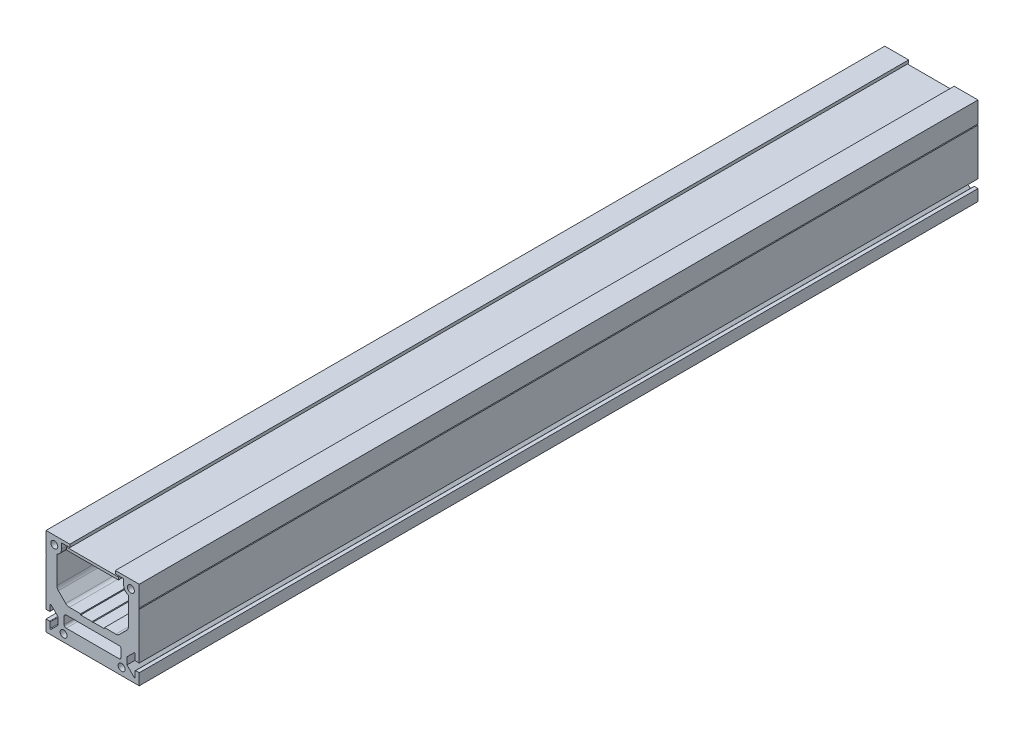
ISO-10303-21;
HEADER;
FILE_DESCRIPTION(('STEP AP214'),'2;1');
FILE_NAME('part.step','',(''),(''),'','','');
FILE_SCHEMA(('AUTOMOTIVE_DESIGN { 1 0 10303 214 1 1 1 1 }'));
ENDSEC;
DATA;
#1=APPLICATION_CONTEXT('core data for automotive mechanical design processes');
#2=APPLICATION_PROTOCOL_DEFINITION('international standard','automotive_design',2000,#1);
#3=PRODUCT_CONTEXT('',#1,'mechanical');
#4=PRODUCT('Part','Part','',(#3));
#5=PRODUCT_RELATED_PRODUCT_CATEGORY('part','',(#4));
#6=PRODUCT_DEFINITION_FORMATION('','',#4);
#7=PRODUCT_DEFINITION_CONTEXT('part definition',#1,'design');
#8=PRODUCT_DEFINITION('design','',#6,#7);
#9=PRODUCT_DEFINITION_SHAPE('','',#8);
#10=(LENGTH_UNIT() NAMED_UNIT(*) SI_UNIT(.MILLI.,.METRE.));
#11=(NAMED_UNIT(*) PLANE_ANGLE_UNIT() SI_UNIT($,.RADIAN.));
#12=(NAMED_UNIT(*) SI_UNIT($,.STERADIAN.) SOLID_ANGLE_UNIT());
#13=UNCERTAINTY_MEASURE_WITH_UNIT(LENGTH_MEASURE(1.E-05),#10,'distance_accuracy_value','');
#14=(GEOMETRIC_REPRESENTATION_CONTEXT(3) GLOBAL_UNCERTAINTY_ASSIGNED_CONTEXT((#13)) GLOBAL_UNIT_ASSIGNED_CONTEXT((#10,
#11,#12)) REPRESENTATION_CONTEXT('',''));
#15=CARTESIAN_POINT('',(0.,0.,0.));
#16=DIRECTION('',(0.,0.,1.));
#17=DIRECTION('',(1.,0.,0.));
#18=AXIS2_PLACEMENT_3D('',#15,#16,#17);
#19=CARTESIAN_POINT('',(-25.,78.5,-810.));
#20=DIRECTION('',(-1.,0.,0.));
#21=DIRECTION('',(0.,-1.,0.));
#22=AXIS2_PLACEMENT_3D('',#19,#20,#21);
#23=PLANE('',#22);
#24=DIRECTION('',(0.,-1.,0.));
#25=VECTOR('',#24,1.);
#26=CARTESIAN_POINT('',(-25.,78.5,0.));
#27=LINE('',#26,#25);
#28=CARTESIAN_POINT('',(-25.,81.,0.));
#29=VERTEX_POINT('',#28);
#30=CARTESIAN_POINT('',(-25.,78.5,0.));
#31=VERTEX_POINT('',#30);
#32=EDGE_CURVE('E107',#29,#31,#27,.T.);
#33=ORIENTED_EDGE('',*,*,#32,.F.);
#34=DIRECTION('',(0.,0.,1.));
#35=VECTOR('',#34,1.);
#36=CARTESIAN_POINT('',(-25.,81.,-810.));
#37=LINE('',#36,#35);
#38=CARTESIAN_POINT('',(-25.,81.,-810.));
#39=VERTEX_POINT('',#38);
#40=EDGE_CURVE('E12',#39,#29,#37,.T.);
#41=ORIENTED_EDGE('',*,*,#40,.F.);
#42=DIRECTION('',(0.,-1.,0.));
#43=VECTOR('',#42,1.);
#44=CARTESIAN_POINT('',(-25.,78.5,-810.));
#45=LINE('',#44,#43);
#46=CARTESIAN_POINT('',(-25.,78.5,-810.));
#47=VERTEX_POINT('',#46);
#48=EDGE_CURVE('E101',#39,#47,#45,.T.);
#49=ORIENTED_EDGE('',*,*,#48,.T.);
#50=DIRECTION('',(0.,0.,1.));
#51=VECTOR('',#50,1.);
#52=CARTESIAN_POINT('',(-25.,78.5,-810.));
#53=LINE('',#52,#51);
#54=EDGE_CURVE('E46',#47,#31,#53,.T.);
#55=ORIENTED_EDGE('',*,*,#54,.T.);
#56=EDGE_LOOP('',(#33,#41,#49,#55));
#57=FACE_BOUND('',#56,.T.);
#58=ADVANCED_FACE('F43',(#57),#23,.T.);
#59=CARTESIAN_POINT('',(-25.,81.,-810.));
#60=DIRECTION('',(0.,1.,0.));
#61=DIRECTION('',(0.,0.,1.));
#62=AXIS2_PLACEMENT_3D('',#59,#60,#61);
#63=PLANE('',#62);
#64=DIRECTION('',(-1.,0.,0.));
#65=VECTOR('',#64,1.);
#66=CARTESIAN_POINT('',(-25.,81.,0.));
#67=LINE('',#66,#65);
#68=CARTESIAN_POINT('',(25.,81.,0.));
#69=VERTEX_POINT('',#68);
#70=EDGE_CURVE('E103',#69,#29,#67,.T.);
#71=ORIENTED_EDGE('',*,*,#70,.F.);
#72=DIRECTION('',(0.,0.,1.));
#73=VECTOR('',#72,1.);
#74=CARTESIAN_POINT('',(25.,81.,-810.));
#75=LINE('',#74,#73);
#76=CARTESIAN_POINT('',(25.,81.,-810.));
#77=VERTEX_POINT('',#76);
#78=EDGE_CURVE('E52',#77,#69,#75,.T.);
#79=ORIENTED_EDGE('',*,*,#78,.F.);
#80=DIRECTION('',(-1.,0.,0.));
#81=VECTOR('',#80,1.);
#82=CARTESIAN_POINT('',(-25.,81.,-810.));
#83=LINE('',#82,#81);
#84=EDGE_CURVE('E98',#77,#39,#83,.T.);
#85=ORIENTED_EDGE('',*,*,#84,.T.);
#86=ORIENTED_EDGE('',*,*,#40,.T.);
#87=EDGE_LOOP('',(#71,#79,#85,#86));
#88=FACE_BOUND('',#87,.T.);
#89=ADVANCED_FACE('F117',(#88),#63,.T.);
#90=CARTESIAN_POINT('',(25.,78.5,-810.));
#91=DIRECTION('',(1.,0.,0.));
#92=DIRECTION('',(0.,0.,-1.));
#93=AXIS2_PLACEMENT_3D('',#90,#91,#92);
#94=PLANE('',#93);
#95=DIRECTION('',(0.,1.,0.));
#96=VECTOR('',#95,1.);
#97=CARTESIAN_POINT('',(25.,78.5,0.));
#98=LINE('',#97,#96);
#99=CARTESIAN_POINT('',(25.,78.5,0.));
#100=VERTEX_POINT('',#99);
#101=EDGE_CURVE('E93',#100,#69,#98,.T.);
#102=ORIENTED_EDGE('',*,*,#101,.F.);
#103=DIRECTION('',(0.,0.,1.));
#104=VECTOR('',#103,1.);
#105=CARTESIAN_POINT('',(25.,78.5,-810.));
#106=LINE('',#105,#104);
#107=CARTESIAN_POINT('',(25.,78.5,-810.));
#108=VERTEX_POINT('',#107);
#109=EDGE_CURVE('E88',#108,#100,#106,.T.);
#110=ORIENTED_EDGE('',*,*,#109,.F.);
#111=DIRECTION('',(0.,1.,0.));
#112=VECTOR('',#111,1.);
#113=CARTESIAN_POINT('',(25.,78.5,-810.));
#114=LINE('',#113,#112);
#115=EDGE_CURVE('E91',#108,#77,#114,.T.);
#116=ORIENTED_EDGE('',*,*,#115,.T.);
#117=ORIENTED_EDGE('',*,*,#78,.T.);
#118=EDGE_LOOP('',(#102,#110,#116,#117));
#119=FACE_BOUND('',#118,.T.);
#120=ADVANCED_FACE('F90',(#119),#94,.T.);
#121=CARTESIAN_POINT('',(-25.,78.5,-810.));
#122=DIRECTION('',(0.,-1.,0.));
#123=DIRECTION('',(0.,0.,-1.));
#124=AXIS2_PLACEMENT_3D('',#121,#122,#123);
#125=PLANE('',#124);
#126=DIRECTION('',(1.,0.,0.));
#127=VECTOR('',#126,1.);
#128=CARTESIAN_POINT('',(-25.,78.5,0.));
#129=LINE('',#128,#127);
#130=EDGE_CURVE('E110',#31,#100,#129,.T.);
#131=ORIENTED_EDGE('',*,*,#130,.F.);
#132=ORIENTED_EDGE('',*,*,#54,.F.);
#133=DIRECTION('',(1.,0.,0.));
#134=VECTOR('',#133,1.);
#135=CARTESIAN_POINT('',(-25.,78.5,-810.));
#136=LINE('',#135,#134);
#137=EDGE_CURVE('E97',#47,#108,#136,.T.);
#138=ORIENTED_EDGE('',*,*,#137,.T.);
#139=ORIENTED_EDGE('',*,*,#109,.T.);
#140=EDGE_LOOP('',(#131,#132,#138,#139));
#141=FACE_BOUND('',#140,.T.);
#142=ADVANCED_FACE('F100',(#141),#125,.T.);
#143=CARTESIAN_POINT('',(-25.,81.,-810.));
#144=DIRECTION('',(0.,0.,-1.));
#145=DIRECTION('',(-1.,0.,0.));
#146=AXIS2_PLACEMENT_3D('',#143,#144,#145);
#147=PLANE('',#146);
#148=ORIENTED_EDGE('',*,*,#48,.F.);
#149=ORIENTED_EDGE('',*,*,#84,.F.);
#150=ORIENTED_EDGE('',*,*,#115,.F.);
#151=ORIENTED_EDGE('',*,*,#137,.F.);
#152=EDGE_LOOP('',(#148,#149,#150,#151));
#153=FACE_BOUND('',#152,.T.);
#154=ADVANCED_FACE('F96',(#153),#147,.T.);
#155=CARTESIAN_POINT('',(-25.,81.,0.));
#156=DIRECTION('',(0.,0.,-1.));
#157=DIRECTION('',(-1.,0.,0.));
#158=AXIS2_PLACEMENT_3D('',#155,#156,#157);
#159=PLANE('',#158);
#160=ORIENTED_EDGE('',*,*,#32,.T.);
#161=ORIENTED_EDGE('',*,*,#130,.T.);
#162=ORIENTED_EDGE('',*,*,#101,.T.);
#163=ORIENTED_EDGE('',*,*,#70,.T.);
#164=EDGE_LOOP('',(#160,#161,#162,#163));
#165=FACE_BOUND('',#164,.T.);
#166=ADVANCED_FACE('F116',(#165),#159,.F.);
#167=CLOSED_SHELL('',(#58,#89,#120,#142,#154,#166));
#168=MANIFOLD_SOLID_BREP('B2',#167);
#169=CARTESIAN_POINT('',(-34.5,32.,-810.));
#170=DIRECTION('',(0.,-1.,0.));
#171=DIRECTION('',(0.,0.,-1.));
#172=AXIS2_PLACEMENT_3D('',#169,#170,#171);
#173=PLANE('',#172);
#174=DIRECTION('',(1.,0.,0.));
#175=VECTOR('',#174,1.);
#176=CARTESIAN_POINT('',(-34.5,32.,-810.));
#177=LINE('',#176,#175);
#178=CARTESIAN_POINT('',(11.5,32.,-810.));
#179=VERTEX_POINT('',#178);
#180=CARTESIAN_POINT('',(22.4289321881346,32.,-810.));
#181=VERTEX_POINT('',#180);
#182=EDGE_CURVE('E744',#179,#181,#177,.T.);
#183=ORIENTED_EDGE('',*,*,#182,.F.);
#184=DIRECTION('',(0.,0.,1.));
#185=VECTOR('',#184,1.);
#186=CARTESIAN_POINT('',(11.5,32.,-810.));
#187=LINE('',#186,#185);
#188=CARTESIAN_POINT('',(11.5,32.,0.));
#189=VERTEX_POINT('',#188);
#190=EDGE_CURVE('E633',#179,#189,#187,.T.);
#191=ORIENTED_EDGE('',*,*,#190,.T.);
#192=DIRECTION('',(1.,0.,0.));
#193=VECTOR('',#192,1.);
#194=CARTESIAN_POINT('',(-34.5,32.,0.));
#195=LINE('',#194,#193);
#196=CARTESIAN_POINT('',(22.4289321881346,32.,0.));
#197=VERTEX_POINT('',#196);
#198=EDGE_CURVE('E766',#189,#197,#195,.T.);
#199=ORIENTED_EDGE('',*,*,#198,.T.);
#200=DIRECTION('',(0.,0.,1.));
#201=VECTOR('',#200,1.);
#202=CARTESIAN_POINT('',(22.4289321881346,32.,-810.));
#203=LINE('',#202,#201);
#204=EDGE_CURVE('E1051',#197,#181,#203,.F.);
#205=ORIENTED_EDGE('',*,*,#204,.T.);
#206=EDGE_LOOP('',(#183,#191,#199,#205));
#207=FACE_BOUND('',#206,.T.);
#208=ADVANCED_FACE('F167',(#207),#173,.F.);
#209=CARTESIAN_POINT('',(-45.,0.,-810.));
#210=DIRECTION('',(-1.,0.,0.));
#211=DIRECTION('',(0.,0.,1.));
#212=AXIS2_PLACEMENT_3D('',#209,#210,#211);
#213=PLANE('',#212);
#214=DIRECTION('',(0.,0.,-1.));
#215=VECTOR('',#214,1.);
#216=CARTESIAN_POINT('',(-45.,65.,-810.));
#217=LINE('',#216,#215);
#218=CARTESIAN_POINT('',(-45.,65.,0.));
#219=VERTEX_POINT('',#218);
#220=CARTESIAN_POINT('',(-45.,65.,-810.));
#221=VERTEX_POINT('',#220);
#222=EDGE_CURVE('E656',#219,#221,#217,.T.);
#223=ORIENTED_EDGE('',*,*,#222,.F.);
#224=DIRECTION('',(0.,-1.,0.));
#225=VECTOR('',#224,1.);
#226=CARTESIAN_POINT('',(-45.,0.,0.));
#227=LINE('',#226,#225);
#228=CARTESIAN_POINT('',(-45.,85.,0.));
#229=VERTEX_POINT('',#228);
#230=EDGE_CURVE('E997',#229,#219,#227,.T.);
#231=ORIENTED_EDGE('',*,*,#230,.F.);
#232=DIRECTION('',(0.,0.,1.));
#233=VECTOR('',#232,1.);
#234=CARTESIAN_POINT('',(-45.,85.,-810.));
#235=LINE('',#234,#233);
#236=CARTESIAN_POINT('',(-45.,85.,-810.));
#237=VERTEX_POINT('',#236);
#238=EDGE_CURVE('E1013',#237,#229,#235,.T.);
#239=ORIENTED_EDGE('',*,*,#238,.F.);
#240=DIRECTION('',(0.,-1.,0.));
#241=VECTOR('',#240,1.);
#242=CARTESIAN_POINT('',(-45.,0.,-810.));
#243=LINE('',#242,#241);
#244=EDGE_CURVE('E979',#237,#221,#243,.T.);
#245=ORIENTED_EDGE('',*,*,#244,.T.);
#246=EDGE_LOOP('',(#223,#231,#239,#245));
#247=FACE_BOUND('',#246,.T.);
#248=ADVANCED_FACE('F1154',(#247),#213,.T.);
#249=CARTESIAN_POINT('',(45.,0.,-810.));
#250=DIRECTION('',(1.,0.,0.));
#251=DIRECTION('',(0.,0.,-1.));
#252=AXIS2_PLACEMENT_3D('',#249,#250,#251);
#253=PLANE('',#252);
#254=DIRECTION('',(0.,0.,-1.));
#255=VECTOR('',#254,1.);
#256=CARTESIAN_POINT('',(45.,64.,-810.));
#257=LINE('',#256,#255);
#258=CARTESIAN_POINT('',(45.,64.,0.));
#259=VERTEX_POINT('',#258);
#260=CARTESIAN_POINT('',(45.,64.,-810.));
#261=VERTEX_POINT('',#260);
#262=EDGE_CURVE('E671',#259,#261,#257,.T.);
#263=ORIENTED_EDGE('',*,*,#262,.F.);
#264=DIRECTION('',(0.,1.,0.));
#265=VECTOR('',#264,1.);
#266=CARTESIAN_POINT('',(45.,0.,0.));
#267=LINE('',#266,#265);
#268=CARTESIAN_POINT('',(45.,19.05,0.));
#269=VERTEX_POINT('',#268);
#270=EDGE_CURVE('E1009',#269,#259,#267,.T.);
#271=ORIENTED_EDGE('',*,*,#270,.F.);
#272=DIRECTION('',(0.,0.,1.));
#273=VECTOR('',#272,1.);
#274=CARTESIAN_POINT('',(45.,19.05,-810.));
#275=LINE('',#274,#273);
#276=CARTESIAN_POINT('',(45.,19.05,-810.));
#277=VERTEX_POINT('',#276);
#278=EDGE_CURVE('E953',#277,#269,#275,.T.);
#279=ORIENTED_EDGE('',*,*,#278,.F.);
#280=DIRECTION('',(0.,1.,0.));
#281=VECTOR('',#280,1.);
#282=CARTESIAN_POINT('',(45.,0.,-810.));
#283=LINE('',#282,#281);
#284=EDGE_CURVE('E992',#277,#261,#283,.T.);
#285=ORIENTED_EDGE('',*,*,#284,.T.);
#286=EDGE_LOOP('',(#263,#271,#279,#285));
#287=FACE_BOUND('',#286,.T.);
#288=ADVANCED_FACE('F1134',(#287),#253,.T.);
#289=CARTESIAN_POINT('',(-45.,85.,-810.));
#290=DIRECTION('',(0.,1.,0.));
#291=DIRECTION('',(0.,0.,1.));
#292=AXIS2_PLACEMENT_3D('',#289,#290,#291);
#293=PLANE('',#292);
#294=DIRECTION('',(0.,0.,-1.));
#295=VECTOR('',#294,1.);
#296=CARTESIAN_POINT('',(22.,85.,-810.));
#297=LINE('',#296,#295);
#298=CARTESIAN_POINT('',(22.,85.,0.));
#299=VERTEX_POINT('',#298);
#300=CARTESIAN_POINT('',(22.,85.,-810.));
#301=VERTEX_POINT('',#300);
#302=EDGE_CURVE('E685',#299,#301,#297,.T.);
#303=ORIENTED_EDGE('',*,*,#302,.F.);
#304=DIRECTION('',(-1.,0.,0.));
#305=VECTOR('',#304,1.);
#306=CARTESIAN_POINT('',(-45.,85.,0.));
#307=LINE('',#306,#305);
#308=CARTESIAN_POINT('',(45.,85.,0.));
#309=VERTEX_POINT('',#308);
#310=EDGE_CURVE('E1010',#309,#299,#307,.T.);
#311=ORIENTED_EDGE('',*,*,#310,.F.);
#312=DIRECTION('',(0.,0.,1.));
#313=VECTOR('',#312,1.);
#314=CARTESIAN_POINT('',(45.,85.,-810.));
#315=LINE('',#314,#313);
#316=CARTESIAN_POINT('',(45.,85.,-810.));
#317=VERTEX_POINT('',#316);
#318=EDGE_CURVE('E1017',#317,#309,#315,.T.);
#319=ORIENTED_EDGE('',*,*,#318,.F.);
#320=DIRECTION('',(-1.,0.,0.));
#321=VECTOR('',#320,1.);
#322=CARTESIAN_POINT('',(-45.,85.,-810.));
#323=LINE('',#322,#321);
#324=EDGE_CURVE('E993',#317,#301,#323,.T.);
#325=ORIENTED_EDGE('',*,*,#324,.T.);
#326=EDGE_LOOP('',(#303,#311,#319,#325));
#327=FACE_BOUND('',#326,.T.);
#328=ADVANCED_FACE('F1232',(#327),#293,.T.);
#329=CARTESIAN_POINT('',(-30.,82.1,-810.));
#330=DIRECTION('',(0.,1.,0.));
#331=DIRECTION('',(0.,0.,1.));
#332=AXIS2_PLACEMENT_3D('',#329,#330,#331);
#333=PLANE('',#332);
#334=DIRECTION('',(-1.,0.,0.));
#335=VECTOR('',#334,1.);
#336=CARTESIAN_POINT('',(-30.,82.1,0.));
#337=LINE('',#336,#335);
#338=CARTESIAN_POINT('',(30.,82.1,0.));
#339=VERTEX_POINT('',#338);
#340=CARTESIAN_POINT('',(22.,82.1,0.));
#341=VERTEX_POINT('',#340);
#342=EDGE_CURVE('E754',#339,#341,#337,.T.);
#343=ORIENTED_EDGE('',*,*,#342,.T.);
#344=DIRECTION('',(0.,0.,-1.));
#345=VECTOR('',#344,1.);
#346=CARTESIAN_POINT('',(22.,82.1,-810.));
#347=LINE('',#346,#345);
#348=CARTESIAN_POINT('',(22.,82.1,-810.));
#349=VERTEX_POINT('',#348);
#350=EDGE_CURVE('E1026',#341,#349,#347,.T.);
#351=ORIENTED_EDGE('',*,*,#350,.T.);
#352=DIRECTION('',(-1.,0.,0.));
#353=VECTOR('',#352,1.);
#354=CARTESIAN_POINT('',(-30.,82.1,-810.));
#355=LINE('',#354,#353);
#356=CARTESIAN_POINT('',(30.,82.1,-810.));
#357=VERTEX_POINT('',#356);
#358=EDGE_CURVE('E732',#357,#349,#355,.T.);
#359=ORIENTED_EDGE('',*,*,#358,.F.);
#360=DIRECTION('',(0.,0.,1.));
#361=VECTOR('',#360,1.);
#362=CARTESIAN_POINT('',(30.,82.1,-810.));
#363=LINE('',#362,#361);
#364=EDGE_CURVE('E782',#357,#339,#363,.T.);
#365=ORIENTED_EDGE('',*,*,#364,.T.);
#366=EDGE_LOOP('',(#343,#351,#359,#365));
#367=FACE_BOUND('',#366,.T.);
#368=ADVANCED_FACE('F1226',(#367),#333,.F.);
#369=DIRECTION('',(0.,0.,1.));
#370=VECTOR('',#369,1.);
#371=CARTESIAN_POINT('',(-45.,10.95,-810.));
#372=LINE('',#371,#370);
#373=CARTESIAN_POINT('',(-45.,10.95,-810.));
#374=VERTEX_POINT('',#373);
#375=CARTESIAN_POINT('',(-45.,10.95,0.));
#376=VERTEX_POINT('',#375);
#377=EDGE_CURVE('E870',#374,#376,#372,.T.);
#378=ORIENTED_EDGE('',*,*,#377,.F.);
#379=CARTESIAN_POINT('',(-45.,0.,-810.));
#380=VERTEX_POINT('',#379);
#381=EDGE_CURVE('E984',#374,#380,#243,.T.);
#382=ORIENTED_EDGE('',*,*,#381,.T.);
#383=DIRECTION('',(0.,0.,1.));
#384=VECTOR('',#383,1.);
#385=CARTESIAN_POINT('',(-45.,0.,-810.));
#386=LINE('',#385,#384);
#387=CARTESIAN_POINT('',(-45.,0.,0.));
#388=VERTEX_POINT('',#387);
#389=EDGE_CURVE('E996',#380,#388,#386,.T.);
#390=ORIENTED_EDGE('',*,*,#389,.T.);
#391=EDGE_CURVE('E955',#376,#388,#227,.T.);
#392=ORIENTED_EDGE('',*,*,#391,.F.);
#393=EDGE_LOOP('',(#378,#382,#390,#392));
#394=FACE_BOUND('',#393,.T.);
#395=ADVANCED_FACE('F1163',(#394),#213,.T.);
#396=DIRECTION('',(0.,0.,1.));
#397=VECTOR('',#396,1.);
#398=CARTESIAN_POINT('',(45.,65.,-810.));
#399=LINE('',#398,#397);
#400=CARTESIAN_POINT('',(45.,65.,-810.));
#401=VERTEX_POINT('',#400);
#402=CARTESIAN_POINT('',(45.,65.,0.));
#403=VERTEX_POINT('',#402);
#404=EDGE_CURVE('E669',#401,#403,#399,.T.);
#405=ORIENTED_EDGE('',*,*,#404,.F.);
#406=EDGE_CURVE('E987',#401,#317,#283,.T.);
#407=ORIENTED_EDGE('',*,*,#406,.T.);
#408=ORIENTED_EDGE('',*,*,#318,.T.);
#409=EDGE_CURVE('E1004',#403,#309,#267,.T.);
#410=ORIENTED_EDGE('',*,*,#409,.F.);
#411=EDGE_LOOP('',(#405,#407,#408,#410));
#412=FACE_BOUND('',#411,.T.);
#413=ADVANCED_FACE('F1124',(#412),#253,.T.);
#414=DIRECTION('',(0.,0.,1.));
#415=VECTOR('',#414,1.);
#416=CARTESIAN_POINT('',(-45.,64.,-810.));
#417=LINE('',#416,#415);
#418=CARTESIAN_POINT('',(-45.,64.,-810.));
#419=VERTEX_POINT('',#418);
#420=CARTESIAN_POINT('',(-45.,64.,0.));
#421=VERTEX_POINT('',#420);
#422=EDGE_CURVE('E190',#419,#421,#417,.T.);
#423=ORIENTED_EDGE('',*,*,#422,.F.);
#424=CARTESIAN_POINT('',(-45.,19.05,-810.));
#425=VERTEX_POINT('',#424);
#426=EDGE_CURVE('E983',#419,#425,#243,.T.);
#427=ORIENTED_EDGE('',*,*,#426,.T.);
#428=DIRECTION('',(0.,0.,1.));
#429=VECTOR('',#428,1.);
#430=CARTESIAN_POINT('',(-45.,19.05,-810.));
#431=LINE('',#430,#429);
#432=CARTESIAN_POINT('',(-45.,19.05,0.));
#433=VERTEX_POINT('',#432);
#434=EDGE_CURVE('E872',#425,#433,#431,.T.);
#435=ORIENTED_EDGE('',*,*,#434,.T.);
#436=EDGE_CURVE('E1001',#421,#433,#227,.T.);
#437=ORIENTED_EDGE('',*,*,#436,.F.);
#438=EDGE_LOOP('',(#423,#427,#435,#437));
#439=FACE_BOUND('',#438,.T.);
#440=ADVANCED_FACE('F1164',(#439),#213,.T.);
#441=DIRECTION('',(0.,0.,1.));
#442=VECTOR('',#441,1.);
#443=CARTESIAN_POINT('',(-22.,85.,-810.));
#444=LINE('',#443,#442);
#445=CARTESIAN_POINT('',(-22.,85.,-810.));
#446=VERTEX_POINT('',#445);
#447=CARTESIAN_POINT('',(-22.,85.,0.));
#448=VERTEX_POINT('',#447);
#449=EDGE_CURVE('E681',#446,#448,#444,.T.);
#450=ORIENTED_EDGE('',*,*,#449,.F.);
#451=EDGE_CURVE('E991',#446,#237,#323,.T.);
#452=ORIENTED_EDGE('',*,*,#451,.T.);
#453=ORIENTED_EDGE('',*,*,#238,.T.);
#454=EDGE_CURVE('E1008',#448,#229,#307,.T.);
#455=ORIENTED_EDGE('',*,*,#454,.F.);
#456=EDGE_LOOP('',(#450,#452,#453,#455));
#457=FACE_BOUND('',#456,.T.);
#458=ADVANCED_FACE('F1235',(#457),#293,.T.);
#459=DIRECTION('',(0.,0.,1.));
#460=VECTOR('',#459,1.);
#461=CARTESIAN_POINT('',(45.,10.95,-810.));
#462=LINE('',#461,#460);
#463=CARTESIAN_POINT('',(45.,10.95,-810.));
#464=VERTEX_POINT('',#463);
#465=CARTESIAN_POINT('',(45.,10.95,0.));
#466=VERTEX_POINT('',#465);
#467=EDGE_CURVE('E956',#464,#466,#462,.T.);
#468=ORIENTED_EDGE('',*,*,#467,.T.);
#469=CARTESIAN_POINT('',(45.,0.,0.));
#470=VERTEX_POINT('',#469);
#471=EDGE_CURVE('E1005',#470,#466,#267,.T.);
#472=ORIENTED_EDGE('',*,*,#471,.F.);
#473=DIRECTION('',(0.,0.,1.));
#474=VECTOR('',#473,1.);
#475=CARTESIAN_POINT('',(45.,0.,-810.));
#476=LINE('',#475,#474);
#477=CARTESIAN_POINT('',(45.,0.,-810.));
#478=VERTEX_POINT('',#477);
#479=EDGE_CURVE('E1020',#478,#470,#476,.T.);
#480=ORIENTED_EDGE('',*,*,#479,.F.);
#481=EDGE_CURVE('E988',#478,#464,#283,.T.);
#482=ORIENTED_EDGE('',*,*,#481,.T.);
#483=EDGE_LOOP('',(#468,#472,#480,#482));
#484=FACE_BOUND('',#483,.T.);
#485=ADVANCED_FACE('F1243',(#484),#253,.T.);
#486=CARTESIAN_POINT('',(-45.,0.,-810.));
#487=DIRECTION('',(0.,-1.,0.));
#488=DIRECTION('',(0.,0.,-1.));
#489=AXIS2_PLACEMENT_3D('',#486,#487,#488);
#490=PLANE('',#489);
#491=DIRECTION('',(1.,0.,0.));
#492=VECTOR('',#491,1.);
#493=CARTESIAN_POINT('',(-45.,0.,0.));
#494=LINE('',#493,#492);
#495=EDGE_CURVE('E1000',#388,#470,#494,.T.);
#496=ORIENTED_EDGE('',*,*,#495,.F.);
#497=ORIENTED_EDGE('',*,*,#389,.F.);
#498=DIRECTION('',(1.,0.,0.));
#499=VECTOR('',#498,1.);
#500=CARTESIAN_POINT('',(-45.,0.,-810.));
#501=LINE('',#500,#499);
#502=EDGE_CURVE('E982',#380,#478,#501,.T.);
#503=ORIENTED_EDGE('',*,*,#502,.T.);
#504=ORIENTED_EDGE('',*,*,#479,.T.);
#505=EDGE_LOOP('',(#496,#497,#503,#504));
#506=FACE_BOUND('',#505,.T.);
#507=ADVANCED_FACE('F1251',(#506),#490,.T.);
#508=CARTESIAN_POINT('',(-45.,85.,-810.));
#509=DIRECTION('',(0.,0.,-1.));
#510=DIRECTION('',(-1.,0.,0.));
#511=AXIS2_PLACEMENT_3D('',#508,#509,#510);
#512=PLANE('',#511);
#513=DIRECTION('',(0.,1.,0.));
#514=VECTOR('',#513,1.);
#515=CARTESIAN_POINT('',(11.5,31.,-810.));
#516=LINE('',#515,#514);
#517=CARTESIAN_POINT('',(11.5,31.,-810.));
#518=VERTEX_POINT('',#517);
#519=EDGE_CURVE('E620',#518,#179,#516,.T.);
#520=ORIENTED_EDGE('',*,*,#519,.T.);
#521=ORIENTED_EDGE('',*,*,#182,.T.);
#522=CARTESIAN_POINT('',(22.4289321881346,37.,-810.));
#523=DIRECTION('',(0.,0.,-1.));
#524=DIRECTION('',(-1.,0.,0.));
#525=AXIS2_PLACEMENT_3D('',#522,#523,#524);
#526=CIRCLE('',#525,5.);
#527=CARTESIAN_POINT('',(25.9644660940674,33.4644660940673,-810.));
#528=VERTEX_POINT('',#527);
#529=EDGE_CURVE('E1065',#181,#528,#526,.F.);
#530=ORIENTED_EDGE('',*,*,#529,.T.);
#531=DIRECTION('',(-0.707106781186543,-0.707106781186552,0.));
#532=VECTOR('',#531,1.);
#533=CARTESIAN_POINT('',(34.5,42.,-810.));
#534=LINE('',#533,#532);
#535=CARTESIAN_POINT('',(33.0355339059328,40.5355339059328,-810.));
#536=VERTEX_POINT('',#535);
#537=EDGE_CURVE('E1032',#528,#536,#534,.F.);
#538=ORIENTED_EDGE('',*,*,#537,.T.);
#539=CARTESIAN_POINT('',(29.5,44.0710678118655,-810.));
#540=DIRECTION('',(0.,0.,-1.));
#541=DIRECTION('',(-1.,0.,0.));
#542=AXIS2_PLACEMENT_3D('',#539,#540,#541);
#543=CIRCLE('',#542,5.);
#544=CARTESIAN_POINT('',(34.5,44.0710678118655,-810.));
#545=VERTEX_POINT('',#544);
#546=EDGE_CURVE('E1063',#536,#545,#543,.F.);
#547=ORIENTED_EDGE('',*,*,#546,.T.);
#548=DIRECTION('',(0.,1.,0.));
#549=VECTOR('',#548,1.);
#550=CARTESIAN_POINT('',(34.5,32.,-810.));
#551=LINE('',#550,#549);
#552=CARTESIAN_POINT('',(34.5,70.461651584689,-810.));
#553=VERTEX_POINT('',#552);
#554=EDGE_CURVE('E746',#545,#553,#551,.T.);
#555=ORIENTED_EDGE('',*,*,#554,.T.);
#556=CARTESIAN_POINT('',(37.,77.,-810.));
#557=DIRECTION('',(0.,0.,-1.));
#558=DIRECTION('',(1.,0.,0.));
#559=AXIS2_PLACEMENT_3D('',#556,#557,#558);
#560=CIRCLE('',#559,7.);
#561=CARTESIAN_POINT('',(30.,77.,-810.));
#562=VERTEX_POINT('',#561);
#563=EDGE_CURVE('E724',#553,#562,#560,.T.);
#564=ORIENTED_EDGE('',*,*,#563,.T.);
#565=DIRECTION('',(0.,1.,0.));
#566=VECTOR('',#565,1.);
#567=CARTESIAN_POINT('',(30.,77.,-810.));
#568=LINE('',#567,#566);
#569=EDGE_CURVE('E727',#562,#357,#568,.T.);
#570=ORIENTED_EDGE('',*,*,#569,.T.);
#571=ORIENTED_EDGE('',*,*,#358,.T.);
#572=DIRECTION('',(0.,1.,0.));
#573=VECTOR('',#572,1.);
#574=CARTESIAN_POINT('',(22.,65.3728591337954,-810.));
#575=LINE('',#574,#573);
#576=EDGE_CURVE('E674',#349,#301,#575,.T.);
#577=ORIENTED_EDGE('',*,*,#576,.T.);
#578=ORIENTED_EDGE('',*,*,#324,.F.);
#579=ORIENTED_EDGE('',*,*,#406,.F.);
#580=DIRECTION('',(-0.707106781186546,-0.70710678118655,0.));
#581=VECTOR('',#580,1.);
#582=CARTESIAN_POINT('',(44.5,64.5,-810.));
#583=LINE('',#582,#581);
#584=CARTESIAN_POINT('',(44.5,64.5,-810.));
#585=VERTEX_POINT('',#584);
#586=EDGE_CURVE('E662',#401,#585,#583,.T.);
#587=ORIENTED_EDGE('',*,*,#586,.T.);
#588=DIRECTION('',(0.70710678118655,-0.707106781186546,0.));
#589=VECTOR('',#588,1.);
#590=CARTESIAN_POINT('',(44.5,64.5,-810.));
#591=LINE('',#590,#589);
#592=EDGE_CURVE('E659',#585,#261,#591,.T.);
#593=ORIENTED_EDGE('',*,*,#592,.T.);
#594=ORIENTED_EDGE('',*,*,#284,.F.);
#595=DIRECTION('',(-1.,0.,0.));
#596=VECTOR('',#595,1.);
#597=CARTESIAN_POINT('',(45.,19.05,-810.));
#598=LINE('',#597,#596);
#599=CARTESIAN_POINT('',(41.5,19.05,-810.));
#600=VERTEX_POINT('',#599);
#601=EDGE_CURVE('E889',#277,#600,#598,.T.);
#602=ORIENTED_EDGE('',*,*,#601,.T.);
#603=CARTESIAN_POINT('',(41.5,19.55,-810.));
#604=DIRECTION('',(0.,0.,-1.));
#605=DIRECTION('',(-1.,0.,0.));
#606=AXIS2_PLACEMENT_3D('',#603,#604,#605);
#607=CIRCLE('',#606,0.499999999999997);
#608=CARTESIAN_POINT('',(41.,19.55,-810.));
#609=VERTEX_POINT('',#608);
#610=EDGE_CURVE('E892',#600,#609,#607,.T.);
#611=ORIENTED_EDGE('',*,*,#610,.T.);
#612=DIRECTION('',(0.,1.,0.));
#613=VECTOR('',#612,1.);
#614=CARTESIAN_POINT('',(41.,19.55,-810.));
#615=LINE('',#614,#613);
#616=CARTESIAN_POINT('',(41.,25.,-810.));
#617=VERTEX_POINT('',#616);
#618=EDGE_CURVE('E896',#609,#617,#615,.T.);
#619=ORIENTED_EDGE('',*,*,#618,.T.);
#620=CARTESIAN_POINT('',(40.5,25.,-810.));
#621=DIRECTION('',(0.,0.,1.));
#622=DIRECTION('',(-1.,0.,0.));
#623=AXIS2_PLACEMENT_3D('',#620,#621,#622);
#624=CIRCLE('',#623,0.500000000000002);
#625=CARTESIAN_POINT('',(40.1464466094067,25.3535533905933,-810.));
#626=VERTEX_POINT('',#625);
#627=EDGE_CURVE('E899',#617,#626,#624,.T.);
#628=ORIENTED_EDGE('',*,*,#627,.T.);
#629=DIRECTION('',(-0.707106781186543,-0.707106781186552,0.));
#630=VECTOR('',#629,1.);
#631=CARTESIAN_POINT('',(40.1464466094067,25.3535533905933,-810.));
#632=LINE('',#631,#630);
#633=CARTESIAN_POINT('',(33.2,18.4071067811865,-810.));
#634=VERTEX_POINT('',#633);
#635=EDGE_CURVE('E902',#626,#634,#632,.T.);
#636=ORIENTED_EDGE('',*,*,#635,.T.);
#637=DIRECTION('',(0.,-1.,0.));
#638=VECTOR('',#637,1.);
#639=CARTESIAN_POINT('',(33.2,18.4071067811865,-810.));
#640=LINE('',#639,#638);
#641=CARTESIAN_POINT('',(33.2,11.5928932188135,-810.));
#642=VERTEX_POINT('',#641);
#643=EDGE_CURVE('E905',#634,#642,#640,.T.);
#644=ORIENTED_EDGE('',*,*,#643,.T.);
#645=DIRECTION('',(0.707106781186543,-0.707106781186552,0.));
#646=VECTOR('',#645,1.);
#647=CARTESIAN_POINT('',(40.1464466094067,4.64644660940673,-810.));
#648=LINE('',#647,#646);
#649=CARTESIAN_POINT('',(40.1464466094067,4.64644660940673,-810.));
#650=VERTEX_POINT('',#649);
#651=EDGE_CURVE('E908',#642,#650,#648,.T.);
#652=ORIENTED_EDGE('',*,*,#651,.T.);
#653=CARTESIAN_POINT('',(40.5,5.,-810.));
#654=DIRECTION('',(0.,0.,1.));
#655=DIRECTION('',(1.,0.,0.));
#656=AXIS2_PLACEMENT_3D('',#653,#654,#655);
#657=CIRCLE('',#656,0.499999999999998);
#658=CARTESIAN_POINT('',(41.,5.,-810.));
#659=VERTEX_POINT('',#658);
#660=EDGE_CURVE('E911',#650,#659,#657,.T.);
#661=ORIENTED_EDGE('',*,*,#660,.T.);
#662=DIRECTION('',(0.,1.,0.));
#663=VECTOR('',#662,1.);
#664=CARTESIAN_POINT('',(41.,10.45,-810.));
#665=LINE('',#664,#663);
#666=CARTESIAN_POINT('',(41.,10.45,-810.));
#667=VERTEX_POINT('',#666);
#668=EDGE_CURVE('E914',#659,#667,#665,.T.);
#669=ORIENTED_EDGE('',*,*,#668,.T.);
#670=CARTESIAN_POINT('',(41.5,10.45,-810.));
#671=DIRECTION('',(0.,0.,-1.));
#672=DIRECTION('',(1.,0.,0.));
#673=AXIS2_PLACEMENT_3D('',#670,#671,#672);
#674=CIRCLE('',#673,0.499999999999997);
#675=CARTESIAN_POINT('',(41.5,10.95,-810.));
#676=VERTEX_POINT('',#675);
#677=EDGE_CURVE('E917',#667,#676,#674,.T.);
#678=ORIENTED_EDGE('',*,*,#677,.T.);
#679=DIRECTION('',(1.,0.,0.));
#680=VECTOR('',#679,1.);
#681=CARTESIAN_POINT('',(45.,10.95,-810.));
#682=LINE('',#681,#680);
#683=EDGE_CURVE('E920',#676,#464,#682,.T.);
#684=ORIENTED_EDGE('',*,*,#683,.T.);
#685=ORIENTED_EDGE('',*,*,#481,.F.);
#686=ORIENTED_EDGE('',*,*,#502,.F.);
#687=ORIENTED_EDGE('',*,*,#381,.F.);
#688=DIRECTION('',(1.,0.,0.));
#689=VECTOR('',#688,1.);
#690=CARTESIAN_POINT('',(-45.,10.95,-810.));
#691=LINE('',#690,#689);
#692=CARTESIAN_POINT('',(-41.5,10.95,-810.));
#693=VERTEX_POINT('',#692);
#694=EDGE_CURVE('E823',#374,#693,#691,.T.);
#695=ORIENTED_EDGE('',*,*,#694,.T.);
#696=CARTESIAN_POINT('',(-41.5,10.45,-810.));
#697=DIRECTION('',(0.,0.,-1.));
#698=DIRECTION('',(-1.,0.,0.));
#699=AXIS2_PLACEMENT_3D('',#696,#697,#698);
#700=CIRCLE('',#699,0.499999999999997);
#701=CARTESIAN_POINT('',(-41.,10.45,-810.));
#702=VERTEX_POINT('',#701);
#703=EDGE_CURVE('E826',#693,#702,#700,.T.);
#704=ORIENTED_EDGE('',*,*,#703,.T.);
#705=DIRECTION('',(0.,-1.,0.));
#706=VECTOR('',#705,1.);
#707=CARTESIAN_POINT('',(-41.,10.45,-810.));
#708=LINE('',#707,#706);
#709=CARTESIAN_POINT('',(-41.,5.,-810.));
#710=VERTEX_POINT('',#709);
#711=EDGE_CURVE('E829',#702,#710,#708,.T.);
#712=ORIENTED_EDGE('',*,*,#711,.T.);
#713=CARTESIAN_POINT('',(-40.5,5.,-810.));
#714=DIRECTION('',(0.,0.,1.));
#715=DIRECTION('',(-1.,0.,0.));
#716=AXIS2_PLACEMENT_3D('',#713,#714,#715);
#717=CIRCLE('',#716,0.499999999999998);
#718=CARTESIAN_POINT('',(-40.1464466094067,4.64644660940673,-810.));
#719=VERTEX_POINT('',#718);
#720=EDGE_CURVE('E798',#710,#719,#717,.T.);
#721=ORIENTED_EDGE('',*,*,#720,.T.);
#722=DIRECTION('',(0.707106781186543,0.707106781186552,0.));
#723=VECTOR('',#722,1.);
#724=CARTESIAN_POINT('',(-40.1464466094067,4.64644660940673,-810.));
#725=LINE('',#724,#723);
#726=CARTESIAN_POINT('',(-33.2,11.5928932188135,-810.));
#727=VERTEX_POINT('',#726);
#728=EDGE_CURVE('E801',#719,#727,#725,.T.);
#729=ORIENTED_EDGE('',*,*,#728,.T.);
#730=DIRECTION('',(0.,1.,0.));
#731=VECTOR('',#730,1.);
#732=CARTESIAN_POINT('',(-33.2,18.4071067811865,-810.));
#733=LINE('',#732,#731);
#734=CARTESIAN_POINT('',(-33.2,18.4071067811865,-810.));
#735=VERTEX_POINT('',#734);
#736=EDGE_CURVE('E805',#727,#735,#733,.T.);
#737=ORIENTED_EDGE('',*,*,#736,.T.);
#738=DIRECTION('',(-0.707106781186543,0.707106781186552,0.));
#739=VECTOR('',#738,1.);
#740=CARTESIAN_POINT('',(-40.1464466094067,25.3535533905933,-810.));
#741=LINE('',#740,#739);
#742=CARTESIAN_POINT('',(-40.1464466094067,25.3535533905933,-810.));
#743=VERTEX_POINT('',#742);
#744=EDGE_CURVE('E808',#735,#743,#741,.T.);
#745=ORIENTED_EDGE('',*,*,#744,.T.);
#746=CARTESIAN_POINT('',(-40.5,25.,-810.));
#747=DIRECTION('',(0.,0.,1.));
#748=DIRECTION('',(1.,0.,0.));
#749=AXIS2_PLACEMENT_3D('',#746,#747,#748);
#750=CIRCLE('',#749,0.499999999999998);
#751=CARTESIAN_POINT('',(-41.,25.,-810.));
#752=VERTEX_POINT('',#751);
#753=EDGE_CURVE('E811',#743,#752,#750,.T.);
#754=ORIENTED_EDGE('',*,*,#753,.T.);
#755=DIRECTION('',(0.,-1.,0.));
#756=VECTOR('',#755,1.);
#757=CARTESIAN_POINT('',(-41.,19.55,-810.));
#758=LINE('',#757,#756);
#759=CARTESIAN_POINT('',(-41.,19.55,-810.));
#760=VERTEX_POINT('',#759);
#761=EDGE_CURVE('E814',#752,#760,#758,.T.);
#762=ORIENTED_EDGE('',*,*,#761,.T.);
#763=CARTESIAN_POINT('',(-41.5,19.55,-810.));
#764=DIRECTION('',(0.,0.,-1.));
#765=DIRECTION('',(1.,0.,0.));
#766=AXIS2_PLACEMENT_3D('',#763,#764,#765);
#767=CIRCLE('',#766,0.499999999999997);
#768=CARTESIAN_POINT('',(-41.5,19.05,-810.));
#769=VERTEX_POINT('',#768);
#770=EDGE_CURVE('E817',#760,#769,#767,.T.);
#771=ORIENTED_EDGE('',*,*,#770,.T.);
#772=DIRECTION('',(-1.,0.,0.));
#773=VECTOR('',#772,1.);
#774=CARTESIAN_POINT('',(-45.,19.05,-810.));
#775=LINE('',#774,#773);
#776=EDGE_CURVE('E820',#769,#425,#775,.T.);
#777=ORIENTED_EDGE('',*,*,#776,.T.);
#778=ORIENTED_EDGE('',*,*,#426,.F.);
#779=DIRECTION('',(0.70710678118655,0.707106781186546,0.));
#780=VECTOR('',#779,1.);
#781=CARTESIAN_POINT('',(-44.5,64.5,-810.));
#782=LINE('',#781,#780);
#783=CARTESIAN_POINT('',(-44.5,64.5,-810.));
#784=VERTEX_POINT('',#783);
#785=EDGE_CURVE('E648',#419,#784,#782,.T.);
#786=ORIENTED_EDGE('',*,*,#785,.T.);
#787=DIRECTION('',(-0.707106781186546,0.70710678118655,0.));
#788=VECTOR('',#787,1.);
#789=CARTESIAN_POINT('',(-44.5,64.5,-810.));
#790=LINE('',#789,#788);
#791=EDGE_CURVE('E645',#784,#221,#790,.T.);
#792=ORIENTED_EDGE('',*,*,#791,.T.);
#793=ORIENTED_EDGE('',*,*,#244,.F.);
#794=ORIENTED_EDGE('',*,*,#451,.F.);
#795=DIRECTION('',(0.,-1.,0.));
#796=VECTOR('',#795,1.);
#797=CARTESIAN_POINT('',(-22.,65.3728591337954,-810.));
#798=LINE('',#797,#796);
#799=CARTESIAN_POINT('',(-22.,82.1,-810.));
#800=VERTEX_POINT('',#799);
#801=EDGE_CURVE('E677',#446,#800,#798,.T.);
#802=ORIENTED_EDGE('',*,*,#801,.T.);
#803=CARTESIAN_POINT('',(-30.,82.1,-810.));
#804=VERTEX_POINT('',#803);
#805=EDGE_CURVE('E731',#800,#804,#355,.T.);
#806=ORIENTED_EDGE('',*,*,#805,.T.);
#807=DIRECTION('',(0.,-1.,0.));
#808=VECTOR('',#807,1.);
#809=CARTESIAN_POINT('',(-30.,77.,-810.));
#810=LINE('',#809,#808);
#811=CARTESIAN_POINT('',(-30.,77.,-810.));
#812=VERTEX_POINT('',#811);
#813=EDGE_CURVE('E735',#804,#812,#810,.T.);
#814=ORIENTED_EDGE('',*,*,#813,.T.);
#815=CARTESIAN_POINT('',(-37.,77.,-810.));
#816=DIRECTION('',(0.,0.,-1.));
#817=DIRECTION('',(1.,0.,0.));
#818=AXIS2_PLACEMENT_3D('',#815,#816,#817);
#819=CIRCLE('',#818,7.);
#820=CARTESIAN_POINT('',(-34.5,70.461651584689,-810.));
#821=VERTEX_POINT('',#820);
#822=EDGE_CURVE('E738',#812,#821,#819,.T.);
#823=ORIENTED_EDGE('',*,*,#822,.T.);
#824=DIRECTION('',(0.,-1.,0.));
#825=VECTOR('',#824,1.);
#826=CARTESIAN_POINT('',(-34.5,32.,-810.));
#827=LINE('',#826,#825);
#828=CARTESIAN_POINT('',(-34.5,44.0710678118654,-810.));
#829=VERTEX_POINT('',#828);
#830=EDGE_CURVE('E741',#821,#829,#827,.T.);
#831=ORIENTED_EDGE('',*,*,#830,.T.);
#832=CARTESIAN_POINT('',(-29.5,44.0710678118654,-810.));
#833=DIRECTION('',(0.,0.,-1.));
#834=DIRECTION('',(-1.,0.,0.));
#835=AXIS2_PLACEMENT_3D('',#832,#833,#834);
#836=CIRCLE('',#835,5.);
#837=CARTESIAN_POINT('',(-33.0355339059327,40.5355339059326,-810.));
#838=VERTEX_POINT('',#837);
#839=EDGE_CURVE('E1074',#829,#838,#836,.F.);
#840=ORIENTED_EDGE('',*,*,#839,.T.);
#841=DIRECTION('',(-0.707106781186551,0.707106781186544,0.));
#842=VECTOR('',#841,1.);
#843=CARTESIAN_POINT('',(-24.5,32.,-810.));
#844=LINE('',#843,#842);
#845=CARTESIAN_POINT('',(-25.9644660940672,33.4644660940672,-810.));
#846=VERTEX_POINT('',#845);
#847=EDGE_CURVE('E1038',#838,#846,#844,.F.);
#848=ORIENTED_EDGE('',*,*,#847,.T.);
#849=CARTESIAN_POINT('',(-22.4289321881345,37.,-810.));
#850=DIRECTION('',(0.,0.,-1.));
#851=DIRECTION('',(-1.,0.,0.));
#852=AXIS2_PLACEMENT_3D('',#849,#850,#851);
#853=CIRCLE('',#852,5.);
#854=CARTESIAN_POINT('',(-22.4289321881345,32.,-810.));
#855=VERTEX_POINT('',#854);
#856=EDGE_CURVE('E1072',#846,#855,#853,.F.);
#857=ORIENTED_EDGE('',*,*,#856,.T.);
#858=CARTESIAN_POINT('',(-11.5,32.,-810.));
#859=VERTEX_POINT('',#858);
#860=EDGE_CURVE('E607',#855,#859,#177,.T.);
#861=ORIENTED_EDGE('',*,*,#860,.T.);
#862=DIRECTION('',(0.,-1.,0.));
#863=VECTOR('',#862,1.);
#864=CARTESIAN_POINT('',(-11.5,32.,-810.));
#865=LINE('',#864,#863);
#866=CARTESIAN_POINT('',(-11.5,31.,-810.));
#867=VERTEX_POINT('',#866);
#868=EDGE_CURVE('E182',#859,#867,#865,.T.);
#869=ORIENTED_EDGE('',*,*,#868,.T.);
#870=DIRECTION('',(1.,0.,0.));
#871=VECTOR('',#870,1.);
#872=CARTESIAN_POINT('',(-11.5,31.,-810.));
#873=LINE('',#872,#871);
#874=CARTESIAN_POINT('',(-0.499999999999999,31.,-810.));
#875=VERTEX_POINT('',#874);
#876=EDGE_CURVE('E595',#867,#875,#873,.T.);
#877=ORIENTED_EDGE('',*,*,#876,.T.);
#878=DIRECTION('',(0.707106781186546,-0.707106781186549,0.));
#879=VECTOR('',#878,1.);
#880=CARTESIAN_POINT('',(-0.499999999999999,31.,-810.));
#881=LINE('',#880,#879);
#882=CARTESIAN_POINT('',(0.,30.5,-810.));
#883=VERTEX_POINT('',#882);
#884=EDGE_CURVE('E600',#875,#883,#881,.T.);
#885=ORIENTED_EDGE('',*,*,#884,.T.);
#886=DIRECTION('',(0.707106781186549,0.707106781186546,0.));
#887=VECTOR('',#886,1.);
#888=CARTESIAN_POINT('',(0.,30.5,-810.));
#889=LINE('',#888,#887);
#890=CARTESIAN_POINT('',(0.500000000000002,31.,-810.));
#891=VERTEX_POINT('',#890);
#892=EDGE_CURVE('E614',#883,#891,#889,.T.);
#893=ORIENTED_EDGE('',*,*,#892,.T.);
#894=DIRECTION('',(1.,0.,0.));
#895=VECTOR('',#894,1.);
#896=CARTESIAN_POINT('',(0.500000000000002,31.,-810.));
#897=LINE('',#896,#895);
#898=EDGE_CURVE('E617',#891,#518,#897,.T.);
#899=ORIENTED_EDGE('',*,*,#898,.T.);
#900=EDGE_LOOP('',(#520,#521,#530,#538,#547,#555,#564,#570,#571,#577,#578,#579,#587,#593,#594,
#602,#611,#619,#628,#636,#644,#652,#661,#669,#678,#684,#685,#686,#687,#695,#704,#712,#721,#729,
#737,#745,#754,#762,#771,#777,#778,#786,#792,#793,#794,#802,#806,#814,#823,#831,#840,#848,#857,
#861,#869,#877,#885,#893,#899));
#901=FACE_BOUND('',#900,.T.);
#902=DIRECTION('',(1.,0.,0.));
#903=VECTOR('',#902,1.);
#904=CARTESIAN_POINT('',(-27.5,13.,-810.));
#905=LINE('',#904,#903);
#906=CARTESIAN_POINT('',(-25.5,13.,-810.));
#907=VERTEX_POINT('',#906);
#908=CARTESIAN_POINT('',(25.5,13.,-810.));
#909=VERTEX_POINT('',#908);
#910=EDGE_CURVE('E698',#907,#909,#905,.T.);
#911=ORIENTED_EDGE('',*,*,#910,.T.);
#912=CARTESIAN_POINT('',(25.5,15.,-810.));
#913=DIRECTION('',(0.,0.,-1.));
#914=DIRECTION('',(-1.,0.,0.));
#915=AXIS2_PLACEMENT_3D('',#912,#913,#914);
#916=CIRCLE('',#915,2.);
#917=CARTESIAN_POINT('',(27.5,15.,-810.));
#918=VERTEX_POINT('',#917);
#919=EDGE_CURVE('E1100',#909,#918,#916,.F.);
#920=ORIENTED_EDGE('',*,*,#919,.T.);
#921=DIRECTION('',(0.,1.,0.));
#922=VECTOR('',#921,1.);
#923=CARTESIAN_POINT('',(27.5,13.,-810.));
#924=LINE('',#923,#922);
#925=CARTESIAN_POINT('',(27.5,22.,-810.));
#926=VERTEX_POINT('',#925);
#927=EDGE_CURVE('E688',#918,#926,#924,.T.);
#928=ORIENTED_EDGE('',*,*,#927,.T.);
#929=CARTESIAN_POINT('',(25.5,22.,-810.));
#930=DIRECTION('',(0.,0.,-1.));
#931=DIRECTION('',(-1.,0.,0.));
#932=AXIS2_PLACEMENT_3D('',#929,#930,#931);
#933=CIRCLE('',#932,2.);
#934=CARTESIAN_POINT('',(25.5,24.,-810.));
#935=VERTEX_POINT('',#934);
#936=EDGE_CURVE('E1104',#926,#935,#933,.F.);
#937=ORIENTED_EDGE('',*,*,#936,.T.);
#938=DIRECTION('',(-1.,0.,0.));
#939=VECTOR('',#938,1.);
#940=CARTESIAN_POINT('',(-27.5,24.,-810.));
#941=LINE('',#940,#939);
#942=CARTESIAN_POINT('',(-25.5,24.,-810.));
#943=VERTEX_POINT('',#942);
#944=EDGE_CURVE('E691',#935,#943,#941,.T.);
#945=ORIENTED_EDGE('',*,*,#944,.T.);
#946=CARTESIAN_POINT('',(-25.5,22.,-810.));
#947=DIRECTION('',(0.,0.,-1.));
#948=DIRECTION('',(-1.,0.,0.));
#949=AXIS2_PLACEMENT_3D('',#946,#947,#948);
#950=CIRCLE('',#949,2.);
#951=CARTESIAN_POINT('',(-27.5,22.,-810.));
#952=VERTEX_POINT('',#951);
#953=EDGE_CURVE('E1112',#943,#952,#950,.F.);
#954=ORIENTED_EDGE('',*,*,#953,.T.);
#955=DIRECTION('',(0.,-1.,0.));
#956=VECTOR('',#955,1.);
#957=CARTESIAN_POINT('',(-27.5,13.,-810.));
#958=LINE('',#957,#956);
#959=CARTESIAN_POINT('',(-27.5,15.,-810.));
#960=VERTEX_POINT('',#959);
#961=EDGE_CURVE('E695',#952,#960,#958,.T.);
#962=ORIENTED_EDGE('',*,*,#961,.T.);
#963=CARTESIAN_POINT('',(-25.5,15.,-810.));
#964=DIRECTION('',(0.,0.,-1.));
#965=DIRECTION('',(-1.,0.,0.));
#966=AXIS2_PLACEMENT_3D('',#963,#964,#965);
#967=CIRCLE('',#966,2.);
#968=EDGE_CURVE('E1108',#960,#907,#967,.F.);
#969=ORIENTED_EDGE('',*,*,#968,.T.);
#970=EDGE_LOOP('',(#911,#920,#928,#937,#945,#954,#962,#969));
#971=FACE_BOUND('',#970,.T.);
#972=CARTESIAN_POINT('',(37.,77.,-810.));
#973=DIRECTION('',(0.,0.,1.));
#974=DIRECTION('',(1.,0.,0.));
#975=AXIS2_PLACEMENT_3D('',#972,#973,#974);
#976=CIRCLE('',#975,3.35000000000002);
#977=CARTESIAN_POINT('',(40.35,77.,-810.));
#978=VERTEX_POINT('',#977);
#979=EDGE_CURVE('E712',#978,#978,#976,.T.);
#980=ORIENTED_EDGE('',*,*,#979,.T.);
#981=EDGE_LOOP('',(#980));
#982=FACE_BOUND('',#981,.T.);
#983=CARTESIAN_POINT('',(-37.,77.,-810.));
#984=DIRECTION('',(0.,0.,1.));
#985=DIRECTION('',(1.,0.,0.));
#986=AXIS2_PLACEMENT_3D('',#983,#984,#985);
#987=CIRCLE('',#986,3.35000000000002);
#988=CARTESIAN_POINT('',(-33.65,77.,-810.));
#989=VERTEX_POINT('',#988);
#990=EDGE_CURVE('E718',#989,#989,#987,.T.);
#991=ORIENTED_EDGE('',*,*,#990,.T.);
#992=EDGE_LOOP('',(#991));
#993=FACE_BOUND('',#992,.T.);
#994=CARTESIAN_POINT('',(-28.,7.,-810.));
#995=DIRECTION('',(0.,0.,1.));
#996=DIRECTION('',(1.,0.,0.));
#997=AXIS2_PLACEMENT_3D('',#994,#995,#996);
#998=CIRCLE('',#997,3.35);
#999=CARTESIAN_POINT('',(-24.65,7.,-810.));
#1000=VERTEX_POINT('',#999);
#1001=EDGE_CURVE('E786',#1000,#1000,#998,.T.);
#1002=ORIENTED_EDGE('',*,*,#1001,.T.);
#1003=EDGE_LOOP('',(#1002));
#1004=FACE_BOUND('',#1003,.T.);
#1005=CARTESIAN_POINT('',(28.,7.,-810.));
#1006=DIRECTION('',(0.,0.,1.));
#1007=DIRECTION('',(1.,0.,0.));
#1008=AXIS2_PLACEMENT_3D('',#1005,#1006,#1007);
#1009=CIRCLE('',#1008,3.35);
#1010=CARTESIAN_POINT('',(31.35,7.,-810.));
#1011=VERTEX_POINT('',#1010);
#1012=EDGE_CURVE('E792',#1011,#1011,#1009,.T.);
#1013=ORIENTED_EDGE('',*,*,#1012,.T.);
#1014=EDGE_LOOP('',(#1013));
#1015=FACE_BOUND('',#1014,.T.);
#1016=ADVANCED_FACE('F604',(#901,#971,#982,#993,#1004,#1015),#512,.T.);
#1017=CARTESIAN_POINT('',(-45.,85.,0.));
#1018=DIRECTION('',(0.,0.,-1.));
#1019=DIRECTION('',(-1.,0.,0.));
#1020=AXIS2_PLACEMENT_3D('',#1017,#1018,#1019);
#1021=PLANE('',#1020);
#1022=DIRECTION('',(-1.,0.,0.));
#1023=VECTOR('',#1022,1.);
#1024=CARTESIAN_POINT('',(-27.5,24.,0.));
#1025=LINE('',#1024,#1023);
#1026=CARTESIAN_POINT('',(25.5,24.,0.));
#1027=VERTEX_POINT('',#1026);
#1028=CARTESIAN_POINT('',(-25.5,24.,0.));
#1029=VERTEX_POINT('',#1028);
#1030=EDGE_CURVE('E704',#1027,#1029,#1025,.T.);
#1031=ORIENTED_EDGE('',*,*,#1030,.F.);
#1032=CARTESIAN_POINT('',(25.5,22.,0.));
#1033=DIRECTION('',(0.,0.,-1.));
#1034=DIRECTION('',(-1.,0.,0.));
#1035=AXIS2_PLACEMENT_3D('',#1032,#1033,#1034);
#1036=CIRCLE('',#1035,2.);
#1037=CARTESIAN_POINT('',(27.5,22.,0.));
#1038=VERTEX_POINT('',#1037);
#1039=EDGE_CURVE('E1102',#1027,#1038,#1036,.T.);
#1040=ORIENTED_EDGE('',*,*,#1039,.T.);
#1041=DIRECTION('',(0.,1.,0.));
#1042=VECTOR('',#1041,1.);
#1043=CARTESIAN_POINT('',(27.5,13.,0.));
#1044=LINE('',#1043,#1042);
#1045=CARTESIAN_POINT('',(27.5,15.,0.));
#1046=VERTEX_POINT('',#1045);
#1047=EDGE_CURVE('E687',#1046,#1038,#1044,.T.);
#1048=ORIENTED_EDGE('',*,*,#1047,.F.);
#1049=CARTESIAN_POINT('',(25.5,15.,0.));
#1050=DIRECTION('',(0.,0.,-1.));
#1051=DIRECTION('',(-1.,0.,0.));
#1052=AXIS2_PLACEMENT_3D('',#1049,#1050,#1051);
#1053=CIRCLE('',#1052,2.);
#1054=CARTESIAN_POINT('',(25.5,13.,0.));
#1055=VERTEX_POINT('',#1054);
#1056=EDGE_CURVE('E1098',#1046,#1055,#1053,.T.);
#1057=ORIENTED_EDGE('',*,*,#1056,.T.);
#1058=DIRECTION('',(1.,0.,0.));
#1059=VECTOR('',#1058,1.);
#1060=CARTESIAN_POINT('',(-27.5,13.,0.));
#1061=LINE('',#1060,#1059);
#1062=CARTESIAN_POINT('',(-25.5,13.,0.));
#1063=VERTEX_POINT('',#1062);
#1064=EDGE_CURVE('E692',#1063,#1055,#1061,.T.);
#1065=ORIENTED_EDGE('',*,*,#1064,.F.);
#1066=CARTESIAN_POINT('',(-25.5,15.,0.));
#1067=DIRECTION('',(0.,0.,-1.));
#1068=DIRECTION('',(-1.,0.,0.));
#1069=AXIS2_PLACEMENT_3D('',#1066,#1067,#1068);
#1070=CIRCLE('',#1069,2.);
#1071=CARTESIAN_POINT('',(-27.5,15.,0.));
#1072=VERTEX_POINT('',#1071);
#1073=EDGE_CURVE('E1106',#1063,#1072,#1070,.T.);
#1074=ORIENTED_EDGE('',*,*,#1073,.T.);
#1075=DIRECTION('',(0.,-1.,0.));
#1076=VECTOR('',#1075,1.);
#1077=CARTESIAN_POINT('',(-27.5,13.,0.));
#1078=LINE('',#1077,#1076);
#1079=CARTESIAN_POINT('',(-27.5,22.,0.));
#1080=VERTEX_POINT('',#1079);
#1081=EDGE_CURVE('E707',#1080,#1072,#1078,.T.);
#1082=ORIENTED_EDGE('',*,*,#1081,.F.);
#1083=CARTESIAN_POINT('',(-25.5,22.,0.));
#1084=DIRECTION('',(0.,0.,-1.));
#1085=DIRECTION('',(-1.,0.,0.));
#1086=AXIS2_PLACEMENT_3D('',#1083,#1084,#1085);
#1087=CIRCLE('',#1086,2.);
#1088=EDGE_CURVE('E1110',#1080,#1029,#1087,.T.);
#1089=ORIENTED_EDGE('',*,*,#1088,.T.);
#1090=EDGE_LOOP('',(#1031,#1040,#1048,#1057,#1065,#1074,#1082,#1089));
#1091=FACE_BOUND('',#1090,.T.);
#1092=CARTESIAN_POINT('',(37.,77.,0.));
#1093=DIRECTION('',(0.,0.,1.));
#1094=DIRECTION('',(1.,0.,0.));
#1095=AXIS2_PLACEMENT_3D('',#1092,#1093,#1094);
#1096=CIRCLE('',#1095,3.35000000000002);
#1097=CARTESIAN_POINT('',(40.35,77.,0.));
#1098=VERTEX_POINT('',#1097);
#1099=EDGE_CURVE('E701',#1098,#1098,#1096,.T.);
#1100=ORIENTED_EDGE('',*,*,#1099,.F.);
#1101=EDGE_LOOP('',(#1100));
#1102=FACE_BOUND('',#1101,.T.);
#1103=CARTESIAN_POINT('',(-37.,77.,0.));
#1104=DIRECTION('',(0.,0.,1.));
#1105=DIRECTION('',(1.,0.,0.));
#1106=AXIS2_PLACEMENT_3D('',#1103,#1104,#1105);
#1107=CIRCLE('',#1106,3.35000000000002);
#1108=CARTESIAN_POINT('',(-33.65,77.,0.));
#1109=VERTEX_POINT('',#1108);
#1110=EDGE_CURVE('E715',#1109,#1109,#1107,.T.);
#1111=ORIENTED_EDGE('',*,*,#1110,.F.);
#1112=EDGE_LOOP('',(#1111));
#1113=FACE_BOUND('',#1112,.T.);
#1114=ORIENTED_EDGE('',*,*,#198,.F.);
#1115=DIRECTION('',(0.,1.,0.));
#1116=VECTOR('',#1115,1.);
#1117=CARTESIAN_POINT('',(11.5,31.,0.));
#1118=LINE('',#1117,#1116);
#1119=CARTESIAN_POINT('',(11.5,31.,0.));
#1120=VERTEX_POINT('',#1119);
#1121=EDGE_CURVE('E608',#1120,#189,#1118,.T.);
#1122=ORIENTED_EDGE('',*,*,#1121,.F.);
#1123=DIRECTION('',(1.,0.,0.));
#1124=VECTOR('',#1123,1.);
#1125=CARTESIAN_POINT('',(0.500000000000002,31.,0.));
#1126=LINE('',#1125,#1124);
#1127=CARTESIAN_POINT('',(0.500000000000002,31.,0.));
#1128=VERTEX_POINT('',#1127);
#1129=EDGE_CURVE('E610',#1128,#1120,#1126,.T.);
#1130=ORIENTED_EDGE('',*,*,#1129,.F.);
#1131=DIRECTION('',(0.707106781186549,0.707106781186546,0.));
#1132=VECTOR('',#1131,1.);
#1133=CARTESIAN_POINT('',(0.,30.5,0.));
#1134=LINE('',#1133,#1132);
#1135=CARTESIAN_POINT('',(0.,30.5,0.));
#1136=VERTEX_POINT('',#1135);
#1137=EDGE_CURVE('E628',#1136,#1128,#1134,.T.);
#1138=ORIENTED_EDGE('',*,*,#1137,.F.);
#1139=DIRECTION('',(0.707106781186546,-0.707106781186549,0.));
#1140=VECTOR('',#1139,1.);
#1141=CARTESIAN_POINT('',(-0.499999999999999,31.,0.));
#1142=LINE('',#1141,#1140);
#1143=CARTESIAN_POINT('',(-0.499999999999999,31.,0.));
#1144=VERTEX_POINT('',#1143);
#1145=EDGE_CURVE('E625',#1144,#1136,#1142,.T.);
#1146=ORIENTED_EDGE('',*,*,#1145,.F.);
#1147=DIRECTION('',(1.,0.,0.));
#1148=VECTOR('',#1147,1.);
#1149=CARTESIAN_POINT('',(-11.5,31.,0.));
#1150=LINE('',#1149,#1148);
#1151=CARTESIAN_POINT('',(-11.5,31.,0.));
#1152=VERTEX_POINT('',#1151);
#1153=EDGE_CURVE('E623',#1152,#1144,#1150,.T.);
#1154=ORIENTED_EDGE('',*,*,#1153,.F.);
#1155=DIRECTION('',(0.,-1.,0.));
#1156=VECTOR('',#1155,1.);
#1157=CARTESIAN_POINT('',(-11.5,32.,0.));
#1158=LINE('',#1157,#1156);
#1159=CARTESIAN_POINT('',(-11.5,32.,0.));
#1160=VERTEX_POINT('',#1159);
#1161=EDGE_CURVE('E587',#1160,#1152,#1158,.T.);
#1162=ORIENTED_EDGE('',*,*,#1161,.F.);
#1163=CARTESIAN_POINT('',(-22.4289321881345,32.,0.));
#1164=VERTEX_POINT('',#1163);
#1165=EDGE_CURVE('E767',#1164,#1160,#195,.T.);
#1166=ORIENTED_EDGE('',*,*,#1165,.F.);
#1167=CARTESIAN_POINT('',(-22.4289321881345,37.,0.));
#1168=DIRECTION('',(0.,0.,-1.));
#1169=DIRECTION('',(-1.,0.,0.));
#1170=AXIS2_PLACEMENT_3D('',#1167,#1168,#1169);
#1171=CIRCLE('',#1170,5.);
#1172=CARTESIAN_POINT('',(-25.9644660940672,33.4644660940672,0.));
#1173=VERTEX_POINT('',#1172);
#1174=EDGE_CURVE('E1070',#1164,#1173,#1171,.T.);
#1175=ORIENTED_EDGE('',*,*,#1174,.T.);
#1176=DIRECTION('',(0.707106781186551,-0.707106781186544,0.));
#1177=VECTOR('',#1176,1.);
#1178=CARTESIAN_POINT('',(-61.2500000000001,68.7499999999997,0.));
#1179=LINE('',#1178,#1177);
#1180=CARTESIAN_POINT('',(-33.0355339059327,40.5355339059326,0.));
#1181=VERTEX_POINT('',#1180);
#1182=EDGE_CURVE('E1035',#1173,#1181,#1179,.F.);
#1183=ORIENTED_EDGE('',*,*,#1182,.T.);
#1184=CARTESIAN_POINT('',(-29.5,44.0710678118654,0.));
#1185=DIRECTION('',(0.,0.,-1.));
#1186=DIRECTION('',(-1.,0.,0.));
#1187=AXIS2_PLACEMENT_3D('',#1184,#1185,#1186);
#1188=CIRCLE('',#1187,5.);
#1189=CARTESIAN_POINT('',(-34.5,44.0710678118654,0.));
#1190=VERTEX_POINT('',#1189);
#1191=EDGE_CURVE('E1076',#1181,#1190,#1188,.T.);
#1192=ORIENTED_EDGE('',*,*,#1191,.T.);
#1193=DIRECTION('',(0.,-1.,0.));
#1194=VECTOR('',#1193,1.);
#1195=CARTESIAN_POINT('',(-34.5,32.,0.));
#1196=LINE('',#1195,#1194);
#1197=CARTESIAN_POINT('',(-34.5,70.461651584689,0.));
#1198=VERTEX_POINT('',#1197);
#1199=EDGE_CURVE('E763',#1198,#1190,#1196,.T.);
#1200=ORIENTED_EDGE('',*,*,#1199,.F.);
#1201=CARTESIAN_POINT('',(-37.,77.,0.));
#1202=DIRECTION('',(0.,0.,-1.));
#1203=DIRECTION('',(1.,0.,0.));
#1204=AXIS2_PLACEMENT_3D('',#1201,#1202,#1203);
#1205=CIRCLE('',#1204,7.);
#1206=CARTESIAN_POINT('',(-30.,77.,0.));
#1207=VERTEX_POINT('',#1206);
#1208=EDGE_CURVE('E760',#1207,#1198,#1205,.T.);
#1209=ORIENTED_EDGE('',*,*,#1208,.F.);
#1210=DIRECTION('',(0.,-1.,0.));
#1211=VECTOR('',#1210,1.);
#1212=CARTESIAN_POINT('',(-30.,77.,0.));
#1213=LINE('',#1212,#1211);
#1214=CARTESIAN_POINT('',(-30.,82.1,0.));
#1215=VERTEX_POINT('',#1214);
#1216=EDGE_CURVE('E757',#1215,#1207,#1213,.T.);
#1217=ORIENTED_EDGE('',*,*,#1216,.F.);
#1218=CARTESIAN_POINT('',(-22.,82.1,0.));
#1219=VERTEX_POINT('',#1218);
#1220=EDGE_CURVE('E753',#1219,#1215,#337,.T.);
#1221=ORIENTED_EDGE('',*,*,#1220,.F.);
#1222=DIRECTION('',(0.,-1.,0.));
#1223=VECTOR('',#1222,1.);
#1224=CARTESIAN_POINT('',(-22.,65.3728591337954,0.));
#1225=LINE('',#1224,#1223);
#1226=EDGE_CURVE('E678',#448,#1219,#1225,.T.);
#1227=ORIENTED_EDGE('',*,*,#1226,.F.);
#1228=ORIENTED_EDGE('',*,*,#454,.T.);
#1229=ORIENTED_EDGE('',*,*,#230,.T.);
#1230=DIRECTION('',(-0.707106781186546,0.70710678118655,0.));
#1231=VECTOR('',#1230,1.);
#1232=CARTESIAN_POINT('',(-44.5,64.5,0.));
#1233=LINE('',#1232,#1231);
#1234=CARTESIAN_POINT('',(-44.5,64.5,0.));
#1235=VERTEX_POINT('',#1234);
#1236=EDGE_CURVE('E636',#1235,#219,#1233,.T.);
#1237=ORIENTED_EDGE('',*,*,#1236,.F.);
#1238=DIRECTION('',(-0.70710678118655,-0.707106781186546,0.));
#1239=VECTOR('',#1238,1.);
#1240=CARTESIAN_POINT('',(-34.5,74.4999999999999,0.));
#1241=LINE('',#1240,#1239);
#1242=EDGE_CURVE('E41',#1235,#421,#1241,.T.);
#1243=ORIENTED_EDGE('',*,*,#1242,.T.);
#1244=ORIENTED_EDGE('',*,*,#436,.T.);
#1245=DIRECTION('',(-1.,0.,0.));
#1246=VECTOR('',#1245,1.);
#1247=CARTESIAN_POINT('',(-45.,19.05,0.));
#1248=LINE('',#1247,#1246);
#1249=CARTESIAN_POINT('',(-41.5,19.05,0.));
#1250=VERTEX_POINT('',#1249);
#1251=EDGE_CURVE('E852',#1250,#433,#1248,.T.);
#1252=ORIENTED_EDGE('',*,*,#1251,.F.);
#1253=CARTESIAN_POINT('',(-41.5,19.55,0.));
#1254=DIRECTION('',(0.,0.,-1.));
#1255=DIRECTION('',(1.,0.,0.));
#1256=AXIS2_PLACEMENT_3D('',#1253,#1254,#1255);
#1257=CIRCLE('',#1256,0.499999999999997);
#1258=CARTESIAN_POINT('',(-41.,19.55,0.));
#1259=VERTEX_POINT('',#1258);
#1260=EDGE_CURVE('E849',#1259,#1250,#1257,.T.);
#1261=ORIENTED_EDGE('',*,*,#1260,.F.);
#1262=DIRECTION('',(0.,-1.,0.));
#1263=VECTOR('',#1262,1.);
#1264=CARTESIAN_POINT('',(-41.,19.55,0.));
#1265=LINE('',#1264,#1263);
#1266=CARTESIAN_POINT('',(-41.,25.,0.));
#1267=VERTEX_POINT('',#1266);
#1268=EDGE_CURVE('E846',#1267,#1259,#1265,.T.);
#1269=ORIENTED_EDGE('',*,*,#1268,.F.);
#1270=CARTESIAN_POINT('',(-40.5,25.,0.));
#1271=DIRECTION('',(0.,0.,1.));
#1272=DIRECTION('',(1.,0.,0.));
#1273=AXIS2_PLACEMENT_3D('',#1270,#1271,#1272);
#1274=CIRCLE('',#1273,0.499999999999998);
#1275=CARTESIAN_POINT('',(-40.1464466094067,25.3535533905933,0.));
#1276=VERTEX_POINT('',#1275);
#1277=EDGE_CURVE('E843',#1276,#1267,#1274,.T.);
#1278=ORIENTED_EDGE('',*,*,#1277,.F.);
#1279=DIRECTION('',(-0.707106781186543,0.707106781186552,0.));
#1280=VECTOR('',#1279,1.);
#1281=CARTESIAN_POINT('',(-40.1464466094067,25.3535533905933,0.));
#1282=LINE('',#1281,#1280);
#1283=CARTESIAN_POINT('',(-33.2,18.4071067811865,0.));
#1284=VERTEX_POINT('',#1283);
#1285=EDGE_CURVE('E840',#1284,#1276,#1282,.T.);
#1286=ORIENTED_EDGE('',*,*,#1285,.F.);
#1287=DIRECTION('',(0.,1.,0.));
#1288=VECTOR('',#1287,1.);
#1289=CARTESIAN_POINT('',(-33.2,18.4071067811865,0.));
#1290=LINE('',#1289,#1288);
#1291=CARTESIAN_POINT('',(-33.2,11.5928932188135,0.));
#1292=VERTEX_POINT('',#1291);
#1293=EDGE_CURVE('E837',#1292,#1284,#1290,.T.);
#1294=ORIENTED_EDGE('',*,*,#1293,.F.);
#1295=DIRECTION('',(0.707106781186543,0.707106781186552,0.));
#1296=VECTOR('',#1295,1.);
#1297=CARTESIAN_POINT('',(-40.1464466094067,4.64644660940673,0.));
#1298=LINE('',#1297,#1296);
#1299=CARTESIAN_POINT('',(-40.1464466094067,4.64644660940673,0.));
#1300=VERTEX_POINT('',#1299);
#1301=EDGE_CURVE('E834',#1300,#1292,#1298,.T.);
#1302=ORIENTED_EDGE('',*,*,#1301,.F.);
#1303=CARTESIAN_POINT('',(-40.5,5.,0.));
#1304=DIRECTION('',(0.,0.,1.));
#1305=DIRECTION('',(-1.,0.,0.));
#1306=AXIS2_PLACEMENT_3D('',#1303,#1304,#1305);
#1307=CIRCLE('',#1306,0.499999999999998);
#1308=CARTESIAN_POINT('',(-41.,5.,0.));
#1309=VERTEX_POINT('',#1308);
#1310=EDGE_CURVE('E795',#1309,#1300,#1307,.T.);
#1311=ORIENTED_EDGE('',*,*,#1310,.F.);
#1312=DIRECTION('',(0.,-1.,0.));
#1313=VECTOR('',#1312,1.);
#1314=CARTESIAN_POINT('',(-41.,10.45,0.));
#1315=LINE('',#1314,#1313);
#1316=CARTESIAN_POINT('',(-41.,10.45,0.));
#1317=VERTEX_POINT('',#1316);
#1318=EDGE_CURVE('E802',#1317,#1309,#1315,.T.);
#1319=ORIENTED_EDGE('',*,*,#1318,.F.);
#1320=CARTESIAN_POINT('',(-41.5,10.45,0.));
#1321=DIRECTION('',(0.,0.,-1.));
#1322=DIRECTION('',(-1.,0.,0.));
#1323=AXIS2_PLACEMENT_3D('',#1320,#1321,#1322);
#1324=CIRCLE('',#1323,0.499999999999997);
#1325=CARTESIAN_POINT('',(-41.5,10.95,0.));
#1326=VERTEX_POINT('',#1325);
#1327=EDGE_CURVE('E858',#1326,#1317,#1324,.T.);
#1328=ORIENTED_EDGE('',*,*,#1327,.F.);
#1329=DIRECTION('',(1.,0.,0.));
#1330=VECTOR('',#1329,1.);
#1331=CARTESIAN_POINT('',(-45.,10.95,0.));
#1332=LINE('',#1331,#1330);
#1333=EDGE_CURVE('E855',#376,#1326,#1332,.T.);
#1334=ORIENTED_EDGE('',*,*,#1333,.F.);
#1335=ORIENTED_EDGE('',*,*,#391,.T.);
#1336=ORIENTED_EDGE('',*,*,#495,.T.);
#1337=ORIENTED_EDGE('',*,*,#471,.T.);
#1338=DIRECTION('',(1.,0.,0.));
#1339=VECTOR('',#1338,1.);
#1340=CARTESIAN_POINT('',(45.,10.95,0.));
#1341=LINE('',#1340,#1339);
#1342=CARTESIAN_POINT('',(41.5,10.95,0.));
#1343=VERTEX_POINT('',#1342);
#1344=EDGE_CURVE('E893',#1343,#466,#1341,.T.);
#1345=ORIENTED_EDGE('',*,*,#1344,.F.);
#1346=CARTESIAN_POINT('',(41.5,10.45,0.));
#1347=DIRECTION('',(0.,0.,-1.));
#1348=DIRECTION('',(1.,0.,0.));
#1349=AXIS2_PLACEMENT_3D('',#1346,#1347,#1348);
#1350=CIRCLE('',#1349,0.499999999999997);
#1351=CARTESIAN_POINT('',(41.,10.45,0.));
#1352=VERTEX_POINT('',#1351);
#1353=EDGE_CURVE('E949',#1352,#1343,#1350,.T.);
#1354=ORIENTED_EDGE('',*,*,#1353,.F.);
#1355=DIRECTION('',(0.,1.,0.));
#1356=VECTOR('',#1355,1.);
#1357=CARTESIAN_POINT('',(41.,10.45,0.));
#1358=LINE('',#1357,#1356);
#1359=CARTESIAN_POINT('',(41.,5.,0.));
#1360=VERTEX_POINT('',#1359);
#1361=EDGE_CURVE('E946',#1360,#1352,#1358,.T.);
#1362=ORIENTED_EDGE('',*,*,#1361,.F.);
#1363=CARTESIAN_POINT('',(40.5,5.,0.));
#1364=DIRECTION('',(0.,0.,1.));
#1365=DIRECTION('',(1.,0.,0.));
#1366=AXIS2_PLACEMENT_3D('',#1363,#1364,#1365);
#1367=CIRCLE('',#1366,0.499999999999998);
#1368=CARTESIAN_POINT('',(40.1464466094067,4.64644660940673,0.));
#1369=VERTEX_POINT('',#1368);
#1370=EDGE_CURVE('E943',#1369,#1360,#1367,.T.);
#1371=ORIENTED_EDGE('',*,*,#1370,.F.);
#1372=DIRECTION('',(0.707106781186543,-0.707106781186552,0.));
#1373=VECTOR('',#1372,1.);
#1374=CARTESIAN_POINT('',(40.1464466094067,4.64644660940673,0.));
#1375=LINE('',#1374,#1373);
#1376=CARTESIAN_POINT('',(33.2,11.5928932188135,0.));
#1377=VERTEX_POINT('',#1376);
#1378=EDGE_CURVE('E940',#1377,#1369,#1375,.T.);
#1379=ORIENTED_EDGE('',*,*,#1378,.F.);
#1380=DIRECTION('',(0.,-1.,0.));
#1381=VECTOR('',#1380,1.);
#1382=CARTESIAN_POINT('',(33.2,18.4071067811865,0.));
#1383=LINE('',#1382,#1381);
#1384=CARTESIAN_POINT('',(33.2,18.4071067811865,0.));
#1385=VERTEX_POINT('',#1384);
#1386=EDGE_CURVE('E937',#1385,#1377,#1383,.T.);
#1387=ORIENTED_EDGE('',*,*,#1386,.F.);
#1388=DIRECTION('',(-0.707106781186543,-0.707106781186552,0.));
#1389=VECTOR('',#1388,1.);
#1390=CARTESIAN_POINT('',(40.1464466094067,25.3535533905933,0.));
#1391=LINE('',#1390,#1389);
#1392=CARTESIAN_POINT('',(40.1464466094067,25.3535533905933,0.));
#1393=VERTEX_POINT('',#1392);
#1394=EDGE_CURVE('E934',#1393,#1385,#1391,.T.);
#1395=ORIENTED_EDGE('',*,*,#1394,.F.);
#1396=CARTESIAN_POINT('',(40.5,25.,0.));
#1397=DIRECTION('',(0.,0.,1.));
#1398=DIRECTION('',(-1.,0.,0.));
#1399=AXIS2_PLACEMENT_3D('',#1396,#1397,#1398);
#1400=CIRCLE('',#1399,0.500000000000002);
#1401=CARTESIAN_POINT('',(41.,25.,0.));
#1402=VERTEX_POINT('',#1401);
#1403=EDGE_CURVE('E931',#1402,#1393,#1400,.T.);
#1404=ORIENTED_EDGE('',*,*,#1403,.F.);
#1405=DIRECTION('',(0.,1.,0.));
#1406=VECTOR('',#1405,1.);
#1407=CARTESIAN_POINT('',(41.,19.55,0.));
#1408=LINE('',#1407,#1406);
#1409=CARTESIAN_POINT('',(41.,19.55,0.));
#1410=VERTEX_POINT('',#1409);
#1411=EDGE_CURVE('E928',#1410,#1402,#1408,.T.);
#1412=ORIENTED_EDGE('',*,*,#1411,.F.);
#1413=CARTESIAN_POINT('',(41.5,19.55,0.));
#1414=DIRECTION('',(0.,0.,-1.));
#1415=DIRECTION('',(-1.,0.,0.));
#1416=AXIS2_PLACEMENT_3D('',#1413,#1414,#1415);
#1417=CIRCLE('',#1416,0.499999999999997);
#1418=CARTESIAN_POINT('',(41.5,19.05,0.));
#1419=VERTEX_POINT('',#1418);
#1420=EDGE_CURVE('E925',#1419,#1410,#1417,.T.);
#1421=ORIENTED_EDGE('',*,*,#1420,.F.);
#1422=DIRECTION('',(-1.,0.,0.));
#1423=VECTOR('',#1422,1.);
#1424=CARTESIAN_POINT('',(45.,19.05,0.));
#1425=LINE('',#1424,#1423);
#1426=EDGE_CURVE('E865',#269,#1419,#1425,.T.);
#1427=ORIENTED_EDGE('',*,*,#1426,.F.);
#1428=ORIENTED_EDGE('',*,*,#270,.T.);
#1429=DIRECTION('',(0.70710678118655,-0.707106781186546,0.));
#1430=VECTOR('',#1429,1.);
#1431=CARTESIAN_POINT('',(44.5,64.5,0.));
#1432=LINE('',#1431,#1430);
#1433=CARTESIAN_POINT('',(44.5,64.5,0.));
#1434=VERTEX_POINT('',#1433);
#1435=EDGE_CURVE('E658',#1434,#259,#1432,.T.);
#1436=ORIENTED_EDGE('',*,*,#1435,.F.);
#1437=DIRECTION('',(0.707106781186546,0.70710678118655,0.));
#1438=VECTOR('',#1437,1.);
#1439=CARTESIAN_POINT('',(10.0000000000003,30.0000000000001,0.));
#1440=LINE('',#1439,#1438);
#1441=EDGE_CURVE('E175',#1434,#403,#1440,.T.);
#1442=ORIENTED_EDGE('',*,*,#1441,.T.);
#1443=ORIENTED_EDGE('',*,*,#409,.T.);
#1444=ORIENTED_EDGE('',*,*,#310,.T.);
#1445=DIRECTION('',(0.,1.,0.));
#1446=VECTOR('',#1445,1.);
#1447=CARTESIAN_POINT('',(22.,65.3728591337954,0.));
#1448=LINE('',#1447,#1446);
#1449=EDGE_CURVE('E673',#341,#299,#1448,.T.);
#1450=ORIENTED_EDGE('',*,*,#1449,.F.);
#1451=ORIENTED_EDGE('',*,*,#342,.F.);
#1452=DIRECTION('',(0.,1.,0.));
#1453=VECTOR('',#1452,1.);
#1454=CARTESIAN_POINT('',(30.,77.,0.));
#1455=LINE('',#1454,#1453);
#1456=CARTESIAN_POINT('',(30.,77.,0.));
#1457=VERTEX_POINT('',#1456);
#1458=EDGE_CURVE('E750',#1457,#339,#1455,.T.);
#1459=ORIENTED_EDGE('',*,*,#1458,.F.);
#1460=CARTESIAN_POINT('',(37.,77.,0.));
#1461=DIRECTION('',(0.,0.,-1.));
#1462=DIRECTION('',(1.,0.,0.));
#1463=AXIS2_PLACEMENT_3D('',#1460,#1461,#1462);
#1464=CIRCLE('',#1463,7.);
#1465=CARTESIAN_POINT('',(34.5,70.461651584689,0.));
#1466=VERTEX_POINT('',#1465);
#1467=EDGE_CURVE('E721',#1466,#1457,#1464,.T.);
#1468=ORIENTED_EDGE('',*,*,#1467,.F.);
#1469=DIRECTION('',(0.,1.,0.));
#1470=VECTOR('',#1469,1.);
#1471=CARTESIAN_POINT('',(34.5,32.,0.));
#1472=LINE('',#1471,#1470);
#1473=CARTESIAN_POINT('',(34.5,44.0710678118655,0.));
#1474=VERTEX_POINT('',#1473);
#1475=EDGE_CURVE('E728',#1474,#1466,#1472,.T.);
#1476=ORIENTED_EDGE('',*,*,#1475,.F.);
#1477=CARTESIAN_POINT('',(29.5,44.0710678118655,0.));
#1478=DIRECTION('',(0.,0.,-1.));
#1479=DIRECTION('',(-1.,0.,0.));
#1480=AXIS2_PLACEMENT_3D('',#1477,#1478,#1479);
#1481=CIRCLE('',#1480,5.);
#1482=CARTESIAN_POINT('',(33.0355339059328,40.5355339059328,0.));
#1483=VERTEX_POINT('',#1482);
#1484=EDGE_CURVE('E1061',#1474,#1483,#1481,.T.);
#1485=ORIENTED_EDGE('',*,*,#1484,.T.);
#1486=DIRECTION('',(0.707106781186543,0.707106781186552,0.));
#1487=VECTOR('',#1486,1.);
#1488=CARTESIAN_POINT('',(16.2500000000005,23.7500000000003,0.));
#1489=LINE('',#1488,#1487);
#1490=CARTESIAN_POINT('',(25.9644660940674,33.4644660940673,0.));
#1491=VERTEX_POINT('',#1490);
#1492=EDGE_CURVE('E1029',#1483,#1491,#1489,.F.);
#1493=ORIENTED_EDGE('',*,*,#1492,.T.);
#1494=CARTESIAN_POINT('',(22.4289321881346,37.,0.));
#1495=DIRECTION('',(0.,0.,-1.));
#1496=DIRECTION('',(-1.,0.,0.));
#1497=AXIS2_PLACEMENT_3D('',#1494,#1495,#1496);
#1498=CIRCLE('',#1497,5.);
#1499=EDGE_CURVE('E1067',#1491,#197,#1498,.T.);
#1500=ORIENTED_EDGE('',*,*,#1499,.T.);
#1501=EDGE_LOOP('',(#1114,#1122,#1130,#1138,#1146,#1154,#1162,#1166,#1175,#1183,#1192,#1200,
#1209,#1217,#1221,#1227,#1228,#1229,#1237,#1243,#1244,#1252,#1261,#1269,#1278,#1286,#1294,#1302,
#1311,#1319,#1328,#1334,#1335,#1336,#1337,#1345,#1354,#1362,#1371,#1379,#1387,#1395,#1404,#1412,
#1421,#1427,#1428,#1436,#1442,#1443,#1444,#1450,#1451,#1459,#1468,#1476,#1485,#1493,#1500));
#1502=FACE_BOUND('',#1501,.T.);
#1503=CARTESIAN_POINT('',(-28.,7.,0.));
#1504=DIRECTION('',(0.,0.,1.));
#1505=DIRECTION('',(1.,0.,0.));
#1506=AXIS2_PLACEMENT_3D('',#1503,#1504,#1505);
#1507=CIRCLE('',#1506,3.35);
#1508=CARTESIAN_POINT('',(-24.65,7.,0.));
#1509=VERTEX_POINT('',#1508);
#1510=EDGE_CURVE('E774',#1509,#1509,#1507,.T.);
#1511=ORIENTED_EDGE('',*,*,#1510,.F.);
#1512=EDGE_LOOP('',(#1511));
#1513=FACE_BOUND('',#1512,.T.);
#1514=CARTESIAN_POINT('',(28.,7.,0.));
#1515=DIRECTION('',(0.,0.,1.));
#1516=DIRECTION('',(1.,0.,0.));
#1517=AXIS2_PLACEMENT_3D('',#1514,#1515,#1516);
#1518=CIRCLE('',#1517,3.35);
#1519=CARTESIAN_POINT('',(31.35,7.,0.));
#1520=VERTEX_POINT('',#1519);
#1521=EDGE_CURVE('E789',#1520,#1520,#1518,.T.);
#1522=ORIENTED_EDGE('',*,*,#1521,.F.);
#1523=EDGE_LOOP('',(#1522));
#1524=FACE_BOUND('',#1523,.T.);
#1525=ADVANCED_FACE('F1118',(#1091,#1102,#1113,#1502,#1513,#1524),#1021,.F.);
#1526=CARTESIAN_POINT('',(45.,19.05,-810.));
#1527=DIRECTION('',(0.,1.,0.));
#1528=DIRECTION('',(0.,0.,1.));
#1529=AXIS2_PLACEMENT_3D('',#1526,#1527,#1528);
#1530=PLANE('',#1529);
#1531=ORIENTED_EDGE('',*,*,#1426,.T.);
#1532=DIRECTION('',(0.,0.,1.));
#1533=VECTOR('',#1532,1.);
#1534=CARTESIAN_POINT('',(41.5,19.05,-810.));
#1535=LINE('',#1534,#1533);
#1536=EDGE_CURVE('E923',#600,#1419,#1535,.T.);
#1537=ORIENTED_EDGE('',*,*,#1536,.F.);
#1538=ORIENTED_EDGE('',*,*,#601,.F.);
#1539=ORIENTED_EDGE('',*,*,#278,.T.);
#1540=EDGE_LOOP('',(#1531,#1537,#1538,#1539));
#1541=FACE_BOUND('',#1540,.T.);
#1542=ADVANCED_FACE('F1347',(#1541),#1530,.F.);
#1543=CARTESIAN_POINT('',(45.,10.95,-810.));
#1544=DIRECTION('',(0.,-1.,0.));
#1545=DIRECTION('',(0.,0.,-1.));
#1546=AXIS2_PLACEMENT_3D('',#1543,#1544,#1545);
#1547=PLANE('',#1546);
#1548=ORIENTED_EDGE('',*,*,#1344,.T.);
#1549=ORIENTED_EDGE('',*,*,#467,.F.);
#1550=ORIENTED_EDGE('',*,*,#683,.F.);
#1551=DIRECTION('',(0.,0.,1.));
#1552=VECTOR('',#1551,1.);
#1553=CARTESIAN_POINT('',(41.5,10.95,-810.));
#1554=LINE('',#1553,#1552);
#1555=EDGE_CURVE('E959',#676,#1343,#1554,.T.);
#1556=ORIENTED_EDGE('',*,*,#1555,.T.);
#1557=EDGE_LOOP('',(#1548,#1549,#1550,#1556));
#1558=FACE_BOUND('',#1557,.T.);
#1559=ADVANCED_FACE('F1671',(#1558),#1547,.F.);
#1560=CARTESIAN_POINT('',(41.5,10.45,-810.));
#1561=DIRECTION('',(0.,0.,1.));
#1562=DIRECTION('',(1.,0.,0.));
#1563=AXIS2_PLACEMENT_3D('',#1560,#1561,#1562);
#1564=CYLINDRICAL_SURFACE('',#1563,0.499999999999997);
#1565=ORIENTED_EDGE('',*,*,#1353,.T.);
#1566=ORIENTED_EDGE('',*,*,#1555,.F.);
#1567=ORIENTED_EDGE('',*,*,#677,.F.);
#1568=DIRECTION('',(0.,0.,1.));
#1569=VECTOR('',#1568,1.);
#1570=CARTESIAN_POINT('',(41.,10.45,-810.));
#1571=LINE('',#1570,#1569);
#1572=EDGE_CURVE('E961',#667,#1352,#1571,.T.);
#1573=ORIENTED_EDGE('',*,*,#1572,.T.);
#1574=EDGE_LOOP('',(#1565,#1566,#1567,#1573));
#1575=FACE_BOUND('',#1574,.T.);
#1576=ADVANCED_FACE('F1680',(#1575),#1564,.T.);
#1577=CARTESIAN_POINT('',(41.,10.45,-810.));
#1578=DIRECTION('',(1.,0.,0.));
#1579=DIRECTION('',(0.,1.,0.));
#1580=AXIS2_PLACEMENT_3D('',#1577,#1578,#1579);
#1581=PLANE('',#1580);
#1582=ORIENTED_EDGE('',*,*,#1361,.T.);
#1583=ORIENTED_EDGE('',*,*,#1572,.F.);
#1584=ORIENTED_EDGE('',*,*,#668,.F.);
#1585=DIRECTION('',(0.,0.,1.));
#1586=VECTOR('',#1585,1.);
#1587=CARTESIAN_POINT('',(41.,5.,-810.));
#1588=LINE('',#1587,#1586);
#1589=EDGE_CURVE('E963',#659,#1360,#1588,.T.);
#1590=ORIENTED_EDGE('',*,*,#1589,.T.);
#1591=EDGE_LOOP('',(#1582,#1583,#1584,#1590));
#1592=FACE_BOUND('',#1591,.T.);
#1593=ADVANCED_FACE('F1689',(#1592),#1581,.F.);
#1594=CARTESIAN_POINT('',(40.5,5.,-810.));
#1595=DIRECTION('',(0.,0.,1.));
#1596=DIRECTION('',(1.,0.,0.));
#1597=AXIS2_PLACEMENT_3D('',#1594,#1595,#1596);
#1598=CYLINDRICAL_SURFACE('',#1597,0.499999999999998);
#1599=ORIENTED_EDGE('',*,*,#1370,.T.);
#1600=ORIENTED_EDGE('',*,*,#1589,.F.);
#1601=ORIENTED_EDGE('',*,*,#660,.F.);
#1602=DIRECTION('',(0.,0.,1.));
#1603=VECTOR('',#1602,1.);
#1604=CARTESIAN_POINT('',(40.1464466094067,4.64644660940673,-810.));
#1605=LINE('',#1604,#1603);
#1606=EDGE_CURVE('E965',#650,#1369,#1605,.T.);
#1607=ORIENTED_EDGE('',*,*,#1606,.T.);
#1608=EDGE_LOOP('',(#1599,#1600,#1601,#1607));
#1609=FACE_BOUND('',#1608,.T.);
#1610=ADVANCED_FACE('F1698',(#1609),#1598,.F.);
#1611=CARTESIAN_POINT('',(40.1464466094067,4.64644660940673,-810.));
#1612=DIRECTION('',(-0.707106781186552,-0.707106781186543,0.));
#1613=DIRECTION('',(0.707106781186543,-0.707106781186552,0.));
#1614=AXIS2_PLACEMENT_3D('',#1611,#1612,#1613);
#1615=PLANE('',#1614);
#1616=ORIENTED_EDGE('',*,*,#1378,.T.);
#1617=ORIENTED_EDGE('',*,*,#1606,.F.);
#1618=ORIENTED_EDGE('',*,*,#651,.F.);
#1619=DIRECTION('',(0.,0.,1.));
#1620=VECTOR('',#1619,1.);
#1621=CARTESIAN_POINT('',(33.2,11.5928932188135,-810.));
#1622=LINE('',#1621,#1620);
#1623=EDGE_CURVE('E967',#642,#1377,#1622,.T.);
#1624=ORIENTED_EDGE('',*,*,#1623,.T.);
#1625=EDGE_LOOP('',(#1616,#1617,#1618,#1624));
#1626=FACE_BOUND('',#1625,.T.);
#1627=ADVANCED_FACE('F1707',(#1626),#1615,.F.);
#1628=CARTESIAN_POINT('',(33.2,18.4071067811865,-810.));
#1629=DIRECTION('',(-1.,0.,0.));
#1630=DIRECTION('',(0.,0.,1.));
#1631=AXIS2_PLACEMENT_3D('',#1628,#1629,#1630);
#1632=PLANE('',#1631);
#1633=ORIENTED_EDGE('',*,*,#1386,.T.);
#1634=ORIENTED_EDGE('',*,*,#1623,.F.);
#1635=ORIENTED_EDGE('',*,*,#643,.F.);
#1636=DIRECTION('',(0.,0.,1.));
#1637=VECTOR('',#1636,1.);
#1638=CARTESIAN_POINT('',(33.2,18.4071067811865,-810.));
#1639=LINE('',#1638,#1637);
#1640=EDGE_CURVE('E969',#634,#1385,#1639,.T.);
#1641=ORIENTED_EDGE('',*,*,#1640,.T.);
#1642=EDGE_LOOP('',(#1633,#1634,#1635,#1641));
#1643=FACE_BOUND('',#1642,.T.);
#1644=ADVANCED_FACE('F1716',(#1643),#1632,.F.);
#1645=CARTESIAN_POINT('',(40.1464466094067,25.3535533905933,-810.));
#1646=DIRECTION('',(-0.707106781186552,0.707106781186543,0.));
#1647=DIRECTION('',(-0.707106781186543,-0.707106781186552,0.));
#1648=AXIS2_PLACEMENT_3D('',#1645,#1646,#1647);
#1649=PLANE('',#1648);
#1650=ORIENTED_EDGE('',*,*,#1394,.T.);
#1651=ORIENTED_EDGE('',*,*,#1640,.F.);
#1652=ORIENTED_EDGE('',*,*,#635,.F.);
#1653=DIRECTION('',(0.,0.,1.));
#1654=VECTOR('',#1653,1.);
#1655=CARTESIAN_POINT('',(40.1464466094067,25.3535533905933,-810.));
#1656=LINE('',#1655,#1654);
#1657=EDGE_CURVE('E971',#626,#1393,#1656,.T.);
#1658=ORIENTED_EDGE('',*,*,#1657,.T.);
#1659=EDGE_LOOP('',(#1650,#1651,#1652,#1658));
#1660=FACE_BOUND('',#1659,.T.);
#1661=ADVANCED_FACE('F1725',(#1660),#1649,.F.);
#1662=CARTESIAN_POINT('',(40.5,25.,-810.));
#1663=DIRECTION('',(0.,0.,1.));
#1664=DIRECTION('',(1.,0.,0.));
#1665=AXIS2_PLACEMENT_3D('',#1662,#1663,#1664);
#1666=CYLINDRICAL_SURFACE('',#1665,0.500000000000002);
#1667=ORIENTED_EDGE('',*,*,#1403,.T.);
#1668=ORIENTED_EDGE('',*,*,#1657,.F.);
#1669=ORIENTED_EDGE('',*,*,#627,.F.);
#1670=DIRECTION('',(0.,0.,1.));
#1671=VECTOR('',#1670,1.);
#1672=CARTESIAN_POINT('',(41.,25.,-810.));
#1673=LINE('',#1672,#1671);
#1674=EDGE_CURVE('E973',#617,#1402,#1673,.T.);
#1675=ORIENTED_EDGE('',*,*,#1674,.T.);
#1676=EDGE_LOOP('',(#1667,#1668,#1669,#1675));
#1677=FACE_BOUND('',#1676,.T.);
#1678=ADVANCED_FACE('F1734',(#1677),#1666,.F.);
#1679=CARTESIAN_POINT('',(41.,19.55,-810.));
#1680=DIRECTION('',(1.,0.,0.));
#1681=DIRECTION('',(0.,1.,0.));
#1682=AXIS2_PLACEMENT_3D('',#1679,#1680,#1681);
#1683=PLANE('',#1682);
#1684=ORIENTED_EDGE('',*,*,#1411,.T.);
#1685=ORIENTED_EDGE('',*,*,#1674,.F.);
#1686=ORIENTED_EDGE('',*,*,#618,.F.);
#1687=DIRECTION('',(0.,0.,1.));
#1688=VECTOR('',#1687,1.);
#1689=CARTESIAN_POINT('',(41.,19.55,-810.));
#1690=LINE('',#1689,#1688);
#1691=EDGE_CURVE('E975',#609,#1410,#1690,.T.);
#1692=ORIENTED_EDGE('',*,*,#1691,.T.);
#1693=EDGE_LOOP('',(#1684,#1685,#1686,#1692));
#1694=FACE_BOUND('',#1693,.T.);
#1695=ADVANCED_FACE('F1743',(#1694),#1683,.F.);
#1696=CARTESIAN_POINT('',(41.5,19.55,-810.));
#1697=DIRECTION('',(0.,0.,1.));
#1698=DIRECTION('',(1.,0.,0.));
#1699=AXIS2_PLACEMENT_3D('',#1696,#1697,#1698);
#1700=CYLINDRICAL_SURFACE('',#1699,0.499999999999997);
#1701=ORIENTED_EDGE('',*,*,#1420,.T.);
#1702=ORIENTED_EDGE('',*,*,#1691,.F.);
#1703=ORIENTED_EDGE('',*,*,#610,.F.);
#1704=ORIENTED_EDGE('',*,*,#1536,.T.);
#1705=EDGE_LOOP('',(#1701,#1702,#1703,#1704));
#1706=FACE_BOUND('',#1705,.T.);
#1707=ADVANCED_FACE('F1752',(#1706),#1700,.T.);
#1708=CARTESIAN_POINT('',(-40.5,5.,-810.));
#1709=DIRECTION('',(0.,0.,1.));
#1710=DIRECTION('',(1.,0.,0.));
#1711=AXIS2_PLACEMENT_3D('',#1708,#1709,#1710);
#1712=CYLINDRICAL_SURFACE('',#1711,0.499999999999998);
#1713=ORIENTED_EDGE('',*,*,#1310,.T.);
#1714=DIRECTION('',(0.,0.,1.));
#1715=VECTOR('',#1714,1.);
#1716=CARTESIAN_POINT('',(-40.1464466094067,4.64644660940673,-810.));
#1717=LINE('',#1716,#1715);
#1718=EDGE_CURVE('E832',#719,#1300,#1717,.T.);
#1719=ORIENTED_EDGE('',*,*,#1718,.F.);
#1720=ORIENTED_EDGE('',*,*,#720,.F.);
#1721=DIRECTION('',(0.,0.,1.));
#1722=VECTOR('',#1721,1.);
#1723=CARTESIAN_POINT('',(-41.,5.,-810.));
#1724=LINE('',#1723,#1722);
#1725=EDGE_CURVE('E863',#710,#1309,#1724,.T.);
#1726=ORIENTED_EDGE('',*,*,#1725,.T.);
#1727=EDGE_LOOP('',(#1713,#1719,#1720,#1726));
#1728=FACE_BOUND('',#1727,.T.);
#1729=ADVANCED_FACE('F1761',(#1728),#1712,.F.);
#1730=CARTESIAN_POINT('',(-41.,10.45,-810.));
#1731=DIRECTION('',(-1.,0.,0.));
#1732=DIRECTION('',(0.,-1.,0.));
#1733=AXIS2_PLACEMENT_3D('',#1730,#1731,#1732);
#1734=PLANE('',#1733);
#1735=ORIENTED_EDGE('',*,*,#1318,.T.);
#1736=ORIENTED_EDGE('',*,*,#1725,.F.);
#1737=ORIENTED_EDGE('',*,*,#711,.F.);
#1738=DIRECTION('',(0.,0.,1.));
#1739=VECTOR('',#1738,1.);
#1740=CARTESIAN_POINT('',(-41.,10.45,-810.));
#1741=LINE('',#1740,#1739);
#1742=EDGE_CURVE('E866',#702,#1317,#1741,.T.);
#1743=ORIENTED_EDGE('',*,*,#1742,.T.);
#1744=EDGE_LOOP('',(#1735,#1736,#1737,#1743));
#1745=FACE_BOUND('',#1744,.T.);
#1746=ADVANCED_FACE('F1770',(#1745),#1734,.F.);
#1747=CARTESIAN_POINT('',(-41.5,10.45,-810.));
#1748=DIRECTION('',(0.,0.,1.));
#1749=DIRECTION('',(1.,0.,0.));
#1750=AXIS2_PLACEMENT_3D('',#1747,#1748,#1749);
#1751=CYLINDRICAL_SURFACE('',#1750,0.499999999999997);
#1752=ORIENTED_EDGE('',*,*,#1327,.T.);
#1753=ORIENTED_EDGE('',*,*,#1742,.F.);
#1754=ORIENTED_EDGE('',*,*,#703,.F.);
#1755=DIRECTION('',(0.,0.,1.));
#1756=VECTOR('',#1755,1.);
#1757=CARTESIAN_POINT('',(-41.5,10.95,-810.));
#1758=LINE('',#1757,#1756);
#1759=EDGE_CURVE('E868',#693,#1326,#1758,.T.);
#1760=ORIENTED_EDGE('',*,*,#1759,.T.);
#1761=EDGE_LOOP('',(#1752,#1753,#1754,#1760));
#1762=FACE_BOUND('',#1761,.T.);
#1763=ADVANCED_FACE('F1779',(#1762),#1751,.T.);
#1764=CARTESIAN_POINT('',(-45.,10.95,-810.));
#1765=DIRECTION('',(0.,-1.,0.));
#1766=DIRECTION('',(0.,0.,-1.));
#1767=AXIS2_PLACEMENT_3D('',#1764,#1765,#1766);
#1768=PLANE('',#1767);
#1769=ORIENTED_EDGE('',*,*,#1333,.T.);
#1770=ORIENTED_EDGE('',*,*,#1759,.F.);
#1771=ORIENTED_EDGE('',*,*,#694,.F.);
#1772=ORIENTED_EDGE('',*,*,#377,.T.);
#1773=EDGE_LOOP('',(#1769,#1770,#1771,#1772));
#1774=FACE_BOUND('',#1773,.T.);
#1775=ADVANCED_FACE('F1788',(#1774),#1768,.F.);
#1776=CARTESIAN_POINT('',(-45.,19.05,-810.));
#1777=DIRECTION('',(0.,1.,0.));
#1778=DIRECTION('',(0.,0.,1.));
#1779=AXIS2_PLACEMENT_3D('',#1776,#1777,#1778);
#1780=PLANE('',#1779);
#1781=ORIENTED_EDGE('',*,*,#1251,.T.);
#1782=ORIENTED_EDGE('',*,*,#434,.F.);
#1783=ORIENTED_EDGE('',*,*,#776,.F.);
#1784=DIRECTION('',(0.,0.,1.));
#1785=VECTOR('',#1784,1.);
#1786=CARTESIAN_POINT('',(-41.5,19.05,-810.));
#1787=LINE('',#1786,#1785);
#1788=EDGE_CURVE('E875',#769,#1250,#1787,.T.);
#1789=ORIENTED_EDGE('',*,*,#1788,.T.);
#1790=EDGE_LOOP('',(#1781,#1782,#1783,#1789));
#1791=FACE_BOUND('',#1790,.T.);
#1792=ADVANCED_FACE('F1797',(#1791),#1780,.F.);
#1793=CARTESIAN_POINT('',(-41.5,19.55,-810.));
#1794=DIRECTION('',(0.,0.,1.));
#1795=DIRECTION('',(1.,0.,0.));
#1796=AXIS2_PLACEMENT_3D('',#1793,#1794,#1795);
#1797=CYLINDRICAL_SURFACE('',#1796,0.499999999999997);
#1798=ORIENTED_EDGE('',*,*,#1260,.T.);
#1799=ORIENTED_EDGE('',*,*,#1788,.F.);
#1800=ORIENTED_EDGE('',*,*,#770,.F.);
#1801=DIRECTION('',(0.,0.,1.));
#1802=VECTOR('',#1801,1.);
#1803=CARTESIAN_POINT('',(-41.,19.55,-810.));
#1804=LINE('',#1803,#1802);
#1805=EDGE_CURVE('E877',#760,#1259,#1804,.T.);
#1806=ORIENTED_EDGE('',*,*,#1805,.T.);
#1807=EDGE_LOOP('',(#1798,#1799,#1800,#1806));
#1808=FACE_BOUND('',#1807,.T.);
#1809=ADVANCED_FACE('F1806',(#1808),#1797,.T.);
#1810=CARTESIAN_POINT('',(-41.,19.55,-810.));
#1811=DIRECTION('',(-1.,0.,0.));
#1812=DIRECTION('',(0.,-1.,0.));
#1813=AXIS2_PLACEMENT_3D('',#1810,#1811,#1812);
#1814=PLANE('',#1813);
#1815=ORIENTED_EDGE('',*,*,#1268,.T.);
#1816=ORIENTED_EDGE('',*,*,#1805,.F.);
#1817=ORIENTED_EDGE('',*,*,#761,.F.);
#1818=DIRECTION('',(0.,0.,1.));
#1819=VECTOR('',#1818,1.);
#1820=CARTESIAN_POINT('',(-41.,25.,-810.));
#1821=LINE('',#1820,#1819);
#1822=EDGE_CURVE('E879',#752,#1267,#1821,.T.);
#1823=ORIENTED_EDGE('',*,*,#1822,.T.);
#1824=EDGE_LOOP('',(#1815,#1816,#1817,#1823));
#1825=FACE_BOUND('',#1824,.T.);
#1826=ADVANCED_FACE('F1815',(#1825),#1814,.F.);
#1827=CARTESIAN_POINT('',(-40.5,25.,-810.));
#1828=DIRECTION('',(0.,0.,1.));
#1829=DIRECTION('',(1.,0.,0.));
#1830=AXIS2_PLACEMENT_3D('',#1827,#1828,#1829);
#1831=CYLINDRICAL_SURFACE('',#1830,0.499999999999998);
#1832=ORIENTED_EDGE('',*,*,#1277,.T.);
#1833=ORIENTED_EDGE('',*,*,#1822,.F.);
#1834=ORIENTED_EDGE('',*,*,#753,.F.);
#1835=DIRECTION('',(0.,0.,1.));
#1836=VECTOR('',#1835,1.);
#1837=CARTESIAN_POINT('',(-40.1464466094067,25.3535533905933,-810.));
#1838=LINE('',#1837,#1836);
#1839=EDGE_CURVE('E881',#743,#1276,#1838,.T.);
#1840=ORIENTED_EDGE('',*,*,#1839,.T.);
#1841=EDGE_LOOP('',(#1832,#1833,#1834,#1840));
#1842=FACE_BOUND('',#1841,.T.);
#1843=ADVANCED_FACE('F1824',(#1842),#1831,.F.);
#1844=CARTESIAN_POINT('',(-40.1464466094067,25.3535533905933,-810.));
#1845=DIRECTION('',(0.707106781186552,0.707106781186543,0.));
#1846=DIRECTION('',(-0.707106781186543,0.707106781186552,0.));
#1847=AXIS2_PLACEMENT_3D('',#1844,#1845,#1846);
#1848=PLANE('',#1847);
#1849=ORIENTED_EDGE('',*,*,#1285,.T.);
#1850=ORIENTED_EDGE('',*,*,#1839,.F.);
#1851=ORIENTED_EDGE('',*,*,#744,.F.);
#1852=DIRECTION('',(0.,0.,1.));
#1853=VECTOR('',#1852,1.);
#1854=CARTESIAN_POINT('',(-33.2,18.4071067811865,-810.));
#1855=LINE('',#1854,#1853);
#1856=EDGE_CURVE('E883',#735,#1284,#1855,.T.);
#1857=ORIENTED_EDGE('',*,*,#1856,.T.);
#1858=EDGE_LOOP('',(#1849,#1850,#1851,#1857));
#1859=FACE_BOUND('',#1858,.T.);
#1860=ADVANCED_FACE('F1833',(#1859),#1848,.F.);
#1861=CARTESIAN_POINT('',(-33.2,18.4071067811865,-810.));
#1862=DIRECTION('',(1.,0.,0.));
#1863=DIRECTION('',(0.,0.,-1.));
#1864=AXIS2_PLACEMENT_3D('',#1861,#1862,#1863);
#1865=PLANE('',#1864);
#1866=ORIENTED_EDGE('',*,*,#1293,.T.);
#1867=ORIENTED_EDGE('',*,*,#1856,.F.);
#1868=ORIENTED_EDGE('',*,*,#736,.F.);
#1869=DIRECTION('',(0.,0.,1.));
#1870=VECTOR('',#1869,1.);
#1871=CARTESIAN_POINT('',(-33.2,11.5928932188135,-810.));
#1872=LINE('',#1871,#1870);
#1873=EDGE_CURVE('E885',#727,#1292,#1872,.T.);
#1874=ORIENTED_EDGE('',*,*,#1873,.T.);
#1875=EDGE_LOOP('',(#1866,#1867,#1868,#1874));
#1876=FACE_BOUND('',#1875,.T.);
#1877=ADVANCED_FACE('F1842',(#1876),#1865,.F.);
#1878=CARTESIAN_POINT('',(-40.1464466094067,4.64644660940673,-810.));
#1879=DIRECTION('',(0.707106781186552,-0.707106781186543,0.));
#1880=DIRECTION('',(0.707106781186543,0.707106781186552,0.));
#1881=AXIS2_PLACEMENT_3D('',#1878,#1879,#1880);
#1882=PLANE('',#1881);
#1883=ORIENTED_EDGE('',*,*,#1301,.T.);
#1884=ORIENTED_EDGE('',*,*,#1873,.F.);
#1885=ORIENTED_EDGE('',*,*,#728,.F.);
#1886=ORIENTED_EDGE('',*,*,#1718,.T.);
#1887=EDGE_LOOP('',(#1883,#1884,#1885,#1886));
#1888=FACE_BOUND('',#1887,.T.);
#1889=ADVANCED_FACE('F1851',(#1888),#1882,.F.);
#1890=CARTESIAN_POINT('',(28.,7.,-810.));
#1891=DIRECTION('',(0.,0.,1.));
#1892=DIRECTION('',(1.,0.,0.));
#1893=AXIS2_PLACEMENT_3D('',#1890,#1891,#1892);
#1894=CYLINDRICAL_SURFACE('',#1893,3.35);
#1895=ORIENTED_EDGE('',*,*,#1012,.F.);
#1896=EDGE_LOOP('',(#1895));
#1897=FACE_BOUND('',#1896,.T.);
#1898=ORIENTED_EDGE('',*,*,#1521,.T.);
#1899=EDGE_LOOP('',(#1898));
#1900=FACE_BOUND('',#1899,.T.);
#1901=ADVANCED_FACE('F1860',(#1897,#1900),#1894,.F.);
#1902=CARTESIAN_POINT('',(-28.,7.,-810.));
#1903=DIRECTION('',(0.,0.,1.));
#1904=DIRECTION('',(1.,0.,0.));
#1905=AXIS2_PLACEMENT_3D('',#1902,#1903,#1904);
#1906=CYLINDRICAL_SURFACE('',#1905,3.35);
#1907=ORIENTED_EDGE('',*,*,#1001,.F.);
#1908=EDGE_LOOP('',(#1907));
#1909=FACE_BOUND('',#1908,.T.);
#1910=ORIENTED_EDGE('',*,*,#1510,.T.);
#1911=EDGE_LOOP('',(#1910));
#1912=FACE_BOUND('',#1911,.T.);
#1913=ADVANCED_FACE('F1869',(#1909,#1912),#1906,.F.);
#1914=CARTESIAN_POINT('',(37.,77.,-810.));
#1915=DIRECTION('',(0.,0.,1.));
#1916=DIRECTION('',(1.,0.,0.));
#1917=AXIS2_PLACEMENT_3D('',#1914,#1915,#1916);
#1918=CYLINDRICAL_SURFACE('',#1917,7.);
#1919=ORIENTED_EDGE('',*,*,#1467,.T.);
#1920=DIRECTION('',(0.,0.,1.));
#1921=VECTOR('',#1920,1.);
#1922=CARTESIAN_POINT('',(30.,77.,-810.));
#1923=LINE('',#1922,#1921);
#1924=EDGE_CURVE('E748',#562,#1457,#1923,.T.);
#1925=ORIENTED_EDGE('',*,*,#1924,.F.);
#1926=ORIENTED_EDGE('',*,*,#563,.F.);
#1927=DIRECTION('',(0.,0.,1.));
#1928=VECTOR('',#1927,1.);
#1929=CARTESIAN_POINT('',(34.5,70.461651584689,-810.));
#1930=LINE('',#1929,#1928);
#1931=EDGE_CURVE('E771',#553,#1466,#1930,.T.);
#1932=ORIENTED_EDGE('',*,*,#1931,.T.);
#1933=EDGE_LOOP('',(#1919,#1925,#1926,#1932));
#1934=FACE_BOUND('',#1933,.T.);
#1935=ADVANCED_FACE('F1178',(#1934),#1918,.T.);
#1936=CARTESIAN_POINT('',(34.5,32.,-810.));
#1937=DIRECTION('',(1.,0.,0.));
#1938=DIRECTION('',(0.,1.,0.));
#1939=AXIS2_PLACEMENT_3D('',#1936,#1937,#1938);
#1940=PLANE('',#1939);
#1941=ORIENTED_EDGE('',*,*,#554,.F.);
#1942=DIRECTION('',(0.,0.,-1.));
#1943=VECTOR('',#1942,1.);
#1944=CARTESIAN_POINT('',(34.5,44.0710678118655,0.));
#1945=LINE('',#1944,#1943);
#1946=EDGE_CURVE('E1041',#545,#1474,#1945,.F.);
#1947=ORIENTED_EDGE('',*,*,#1946,.T.);
#1948=ORIENTED_EDGE('',*,*,#1475,.T.);
#1949=ORIENTED_EDGE('',*,*,#1931,.F.);
#1950=EDGE_LOOP('',(#1941,#1947,#1948,#1949));
#1951=FACE_BOUND('',#1950,.T.);
#1952=ADVANCED_FACE('F1170',(#1951),#1940,.F.);
#1953=ORIENTED_EDGE('',*,*,#1165,.T.);
#1954=DIRECTION('',(0.,0.,1.));
#1955=VECTOR('',#1954,1.);
#1956=CARTESIAN_POINT('',(-11.5,32.,-810.));
#1957=LINE('',#1956,#1955);
#1958=EDGE_CURVE('E592',#859,#1160,#1957,.T.);
#1959=ORIENTED_EDGE('',*,*,#1958,.F.);
#1960=ORIENTED_EDGE('',*,*,#860,.F.);
#1961=DIRECTION('',(0.,0.,-1.));
#1962=VECTOR('',#1961,1.);
#1963=CARTESIAN_POINT('',(-22.4289321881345,32.,0.));
#1964=LINE('',#1963,#1962);
#1965=EDGE_CURVE('E1048',#855,#1164,#1964,.F.);
#1966=ORIENTED_EDGE('',*,*,#1965,.T.);
#1967=EDGE_LOOP('',(#1953,#1959,#1960,#1966));
#1968=FACE_BOUND('',#1967,.T.);
#1969=ADVANCED_FACE('F1157',(#1968),#173,.F.);
#1970=CARTESIAN_POINT('',(-34.5,32.,-810.));
#1971=DIRECTION('',(-1.,0.,0.));
#1972=DIRECTION('',(0.,0.,1.));
#1973=AXIS2_PLACEMENT_3D('',#1970,#1971,#1972);
#1974=PLANE('',#1973);
#1975=ORIENTED_EDGE('',*,*,#1199,.T.);
#1976=DIRECTION('',(0.,0.,1.));
#1977=VECTOR('',#1976,1.);
#1978=CARTESIAN_POINT('',(-34.5,44.0710678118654,-810.));
#1979=LINE('',#1978,#1977);
#1980=EDGE_CURVE('E1058',#1190,#829,#1979,.F.);
#1981=ORIENTED_EDGE('',*,*,#1980,.T.);
#1982=ORIENTED_EDGE('',*,*,#830,.F.);
#1983=DIRECTION('',(0.,0.,1.));
#1984=VECTOR('',#1983,1.);
#1985=CARTESIAN_POINT('',(-34.5,70.461651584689,-810.));
#1986=LINE('',#1985,#1984);
#1987=EDGE_CURVE('E775',#821,#1198,#1986,.T.);
#1988=ORIENTED_EDGE('',*,*,#1987,.T.);
#1989=EDGE_LOOP('',(#1975,#1981,#1982,#1988));
#1990=FACE_BOUND('',#1989,.T.);
#1991=ADVANCED_FACE('F1169',(#1990),#1974,.F.);
#1992=CARTESIAN_POINT('',(-37.,77.,-810.));
#1993=DIRECTION('',(0.,0.,1.));
#1994=DIRECTION('',(1.,0.,0.));
#1995=AXIS2_PLACEMENT_3D('',#1992,#1993,#1994);
#1996=CYLINDRICAL_SURFACE('',#1995,7.);
#1997=ORIENTED_EDGE('',*,*,#1208,.T.);
#1998=ORIENTED_EDGE('',*,*,#1987,.F.);
#1999=ORIENTED_EDGE('',*,*,#822,.F.);
#2000=DIRECTION('',(0.,0.,1.));
#2001=VECTOR('',#2000,1.);
#2002=CARTESIAN_POINT('',(-30.,77.,-810.));
#2003=LINE('',#2002,#2001);
#2004=EDGE_CURVE('E777',#812,#1207,#2003,.T.);
#2005=ORIENTED_EDGE('',*,*,#2004,.T.);
#2006=EDGE_LOOP('',(#1997,#1998,#1999,#2005));
#2007=FACE_BOUND('',#2006,.T.);
#2008=ADVANCED_FACE('F1176',(#2007),#1996,.T.);
#2009=CARTESIAN_POINT('',(-30.,77.,-810.));
#2010=DIRECTION('',(-1.,0.,0.));
#2011=DIRECTION('',(0.,0.,1.));
#2012=AXIS2_PLACEMENT_3D('',#2009,#2010,#2011);
#2013=PLANE('',#2012);
#2014=ORIENTED_EDGE('',*,*,#1216,.T.);
#2015=ORIENTED_EDGE('',*,*,#2004,.F.);
#2016=ORIENTED_EDGE('',*,*,#813,.F.);
#2017=DIRECTION('',(0.,0.,1.));
#2018=VECTOR('',#2017,1.);
#2019=CARTESIAN_POINT('',(-30.,82.1,-810.));
#2020=LINE('',#2019,#2018);
#2021=EDGE_CURVE('E779',#804,#1215,#2020,.T.);
#2022=ORIENTED_EDGE('',*,*,#2021,.T.);
#2023=EDGE_LOOP('',(#2014,#2015,#2016,#2022));
#2024=FACE_BOUND('',#2023,.T.);
#2025=ADVANCED_FACE('F1274',(#2024),#2013,.F.);
#2026=ORIENTED_EDGE('',*,*,#805,.F.);
#2027=DIRECTION('',(0.,0.,1.));
#2028=VECTOR('',#2027,1.);
#2029=CARTESIAN_POINT('',(-22.,82.1,-810.));
#2030=LINE('',#2029,#2028);
#2031=EDGE_CURVE('E1016',#800,#1219,#2030,.T.);
#2032=ORIENTED_EDGE('',*,*,#2031,.T.);
#2033=ORIENTED_EDGE('',*,*,#1220,.T.);
#2034=ORIENTED_EDGE('',*,*,#2021,.F.);
#2035=EDGE_LOOP('',(#2026,#2032,#2033,#2034));
#2036=FACE_BOUND('',#2035,.T.);
#2037=ADVANCED_FACE('F1241',(#2036),#333,.F.);
#2038=CARTESIAN_POINT('',(30.,77.,-810.));
#2039=DIRECTION('',(1.,0.,0.));
#2040=DIRECTION('',(0.,0.,-1.));
#2041=AXIS2_PLACEMENT_3D('',#2038,#2039,#2040);
#2042=PLANE('',#2041);
#2043=ORIENTED_EDGE('',*,*,#1458,.T.);
#2044=ORIENTED_EDGE('',*,*,#364,.F.);
#2045=ORIENTED_EDGE('',*,*,#569,.F.);
#2046=ORIENTED_EDGE('',*,*,#1924,.T.);
#2047=EDGE_LOOP('',(#2043,#2044,#2045,#2046));
#2048=FACE_BOUND('',#2047,.T.);
#2049=ADVANCED_FACE('F1222',(#2048),#2042,.F.);
#2050=CARTESIAN_POINT('',(-37.,77.,-810.));
#2051=DIRECTION('',(0.,0.,1.));
#2052=DIRECTION('',(1.,0.,0.));
#2053=AXIS2_PLACEMENT_3D('',#2050,#2051,#2052);
#2054=CYLINDRICAL_SURFACE('',#2053,3.35000000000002);
#2055=ORIENTED_EDGE('',*,*,#990,.F.);
#2056=EDGE_LOOP('',(#2055));
#2057=FACE_BOUND('',#2056,.T.);
#2058=ORIENTED_EDGE('',*,*,#1110,.T.);
#2059=EDGE_LOOP('',(#2058));
#2060=FACE_BOUND('',#2059,.T.);
#2061=ADVANCED_FACE('F1352',(#2057,#2060),#2054,.F.);
#2062=CARTESIAN_POINT('',(37.,77.,-810.));
#2063=DIRECTION('',(0.,0.,1.));
#2064=DIRECTION('',(1.,0.,0.));
#2065=AXIS2_PLACEMENT_3D('',#2062,#2063,#2064);
#2066=CYLINDRICAL_SURFACE('',#2065,3.35000000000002);
#2067=ORIENTED_EDGE('',*,*,#979,.F.);
#2068=EDGE_LOOP('',(#2067));
#2069=FACE_BOUND('',#2068,.T.);
#2070=ORIENTED_EDGE('',*,*,#1099,.T.);
#2071=EDGE_LOOP('',(#2070));
#2072=FACE_BOUND('',#2071,.T.);
#2073=ADVANCED_FACE('F1354',(#2069,#2072),#2066,.F.);
#2074=CARTESIAN_POINT('',(27.5,13.,-810.));
#2075=DIRECTION('',(1.,0.,0.));
#2076=DIRECTION('',(0.,1.,0.));
#2077=AXIS2_PLACEMENT_3D('',#2074,#2075,#2076);
#2078=PLANE('',#2077);
#2079=ORIENTED_EDGE('',*,*,#927,.F.);
#2080=DIRECTION('',(0.,0.,1.));
#2081=VECTOR('',#2080,1.);
#2082=CARTESIAN_POINT('',(27.5,15.,0.));
#2083=LINE('',#2082,#2081);
#2084=EDGE_CURVE('E1080',#918,#1046,#2083,.T.);
#2085=ORIENTED_EDGE('',*,*,#2084,.T.);
#2086=ORIENTED_EDGE('',*,*,#1047,.T.);
#2087=DIRECTION('',(0.,0.,1.));
#2088=VECTOR('',#2087,1.);
#2089=CARTESIAN_POINT('',(27.5,22.,-810.));
#2090=LINE('',#2089,#2088);
#2091=EDGE_CURVE('E1078',#1038,#926,#2090,.F.);
#2092=ORIENTED_EDGE('',*,*,#2091,.T.);
#2093=EDGE_LOOP('',(#2079,#2085,#2086,#2092));
#2094=FACE_BOUND('',#2093,.T.);
#2095=ADVANCED_FACE('F1330',(#2094),#2078,.F.);
#2096=CARTESIAN_POINT('',(-27.5,13.,-810.));
#2097=DIRECTION('',(0.,-1.,0.));
#2098=DIRECTION('',(1.,0.,0.));
#2099=AXIS2_PLACEMENT_3D('',#2096,#2097,#2098);
#2100=PLANE('',#2099);
#2101=ORIENTED_EDGE('',*,*,#1064,.T.);
#2102=DIRECTION('',(0.,0.,1.));
#2103=VECTOR('',#2102,1.);
#2104=CARTESIAN_POINT('',(25.5,13.,-810.));
#2105=LINE('',#2104,#2103);
#2106=EDGE_CURVE('E1086',#1055,#909,#2105,.F.);
#2107=ORIENTED_EDGE('',*,*,#2106,.T.);
#2108=ORIENTED_EDGE('',*,*,#910,.F.);
#2109=DIRECTION('',(0.,0.,1.));
#2110=VECTOR('',#2109,1.);
#2111=CARTESIAN_POINT('',(-25.5,13.,0.));
#2112=LINE('',#2111,#2110);
#2113=EDGE_CURVE('E1083',#907,#1063,#2112,.T.);
#2114=ORIENTED_EDGE('',*,*,#2113,.T.);
#2115=EDGE_LOOP('',(#2101,#2107,#2108,#2114));
#2116=FACE_BOUND('',#2115,.T.);
#2117=ADVANCED_FACE('F1323',(#2116),#2100,.F.);
#2118=CARTESIAN_POINT('',(-27.5,13.,-810.));
#2119=DIRECTION('',(-1.,0.,0.));
#2120=DIRECTION('',(0.,-1.,0.));
#2121=AXIS2_PLACEMENT_3D('',#2118,#2119,#2120);
#2122=PLANE('',#2121);
#2123=ORIENTED_EDGE('',*,*,#1081,.T.);
#2124=DIRECTION('',(0.,0.,1.));
#2125=VECTOR('',#2124,1.);
#2126=CARTESIAN_POINT('',(-27.5,15.,-810.));
#2127=LINE('',#2126,#2125);
#2128=EDGE_CURVE('E1096',#1072,#960,#2127,.F.);
#2129=ORIENTED_EDGE('',*,*,#2128,.T.);
#2130=ORIENTED_EDGE('',*,*,#961,.F.);
#2131=DIRECTION('',(0.,0.,1.));
#2132=VECTOR('',#2131,1.);
#2133=CARTESIAN_POINT('',(-27.5,22.,0.));
#2134=LINE('',#2133,#2132);
#2135=EDGE_CURVE('E1093',#952,#1080,#2134,.T.);
#2136=ORIENTED_EDGE('',*,*,#2135,.T.);
#2137=EDGE_LOOP('',(#2123,#2129,#2130,#2136));
#2138=FACE_BOUND('',#2137,.T.);
#2139=ADVANCED_FACE('F1342',(#2138),#2122,.F.);
#2140=CARTESIAN_POINT('',(-27.5,24.,-810.));
#2141=DIRECTION('',(0.,1.,0.));
#2142=DIRECTION('',(0.,0.,1.));
#2143=AXIS2_PLACEMENT_3D('',#2140,#2141,#2142);
#2144=PLANE('',#2143);
#2145=ORIENTED_EDGE('',*,*,#944,.F.);
#2146=DIRECTION('',(0.,0.,1.));
#2147=VECTOR('',#2146,1.);
#2148=CARTESIAN_POINT('',(25.5,24.,0.));
#2149=LINE('',#2148,#2147);
#2150=EDGE_CURVE('E1090',#935,#1027,#2149,.T.);
#2151=ORIENTED_EDGE('',*,*,#2150,.T.);
#2152=ORIENTED_EDGE('',*,*,#1030,.T.);
#2153=DIRECTION('',(0.,0.,1.));
#2154=VECTOR('',#2153,1.);
#2155=CARTESIAN_POINT('',(-25.5,24.,-810.));
#2156=LINE('',#2155,#2154);
#2157=EDGE_CURVE('E1088',#1029,#943,#2156,.F.);
#2158=ORIENTED_EDGE('',*,*,#2157,.T.);
#2159=EDGE_LOOP('',(#2145,#2151,#2152,#2158));
#2160=FACE_BOUND('',#2159,.T.);
#2161=ADVANCED_FACE('F1337',(#2160),#2144,.F.);
#2162=CARTESIAN_POINT('',(-22.,65.3728591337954,-810.));
#2163=DIRECTION('',(-1.,0.,0.));
#2164=DIRECTION('',(0.,0.,1.));
#2165=AXIS2_PLACEMENT_3D('',#2162,#2163,#2164);
#2166=PLANE('',#2165);
#2167=ORIENTED_EDGE('',*,*,#449,.T.);
#2168=ORIENTED_EDGE('',*,*,#1226,.T.);
#2169=ORIENTED_EDGE('',*,*,#2031,.F.);
#2170=ORIENTED_EDGE('',*,*,#801,.F.);
#2171=EDGE_LOOP('',(#2167,#2168,#2169,#2170));
#2172=FACE_BOUND('',#2171,.T.);
#2173=ADVANCED_FACE('F1268',(#2172),#2166,.F.);
#2174=CARTESIAN_POINT('',(22.,65.3728591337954,-810.));
#2175=DIRECTION('',(1.,0.,0.));
#2176=DIRECTION('',(0.,0.,-1.));
#2177=AXIS2_PLACEMENT_3D('',#2174,#2175,#2176);
#2178=PLANE('',#2177);
#2179=ORIENTED_EDGE('',*,*,#302,.T.);
#2180=ORIENTED_EDGE('',*,*,#576,.F.);
#2181=ORIENTED_EDGE('',*,*,#350,.F.);
#2182=ORIENTED_EDGE('',*,*,#1449,.T.);
#2183=EDGE_LOOP('',(#2179,#2180,#2181,#2182));
#2184=FACE_BOUND('',#2183,.T.);
#2185=ADVANCED_FACE('F1229',(#2184),#2178,.F.);
#2186=CARTESIAN_POINT('',(34.5,42.,-810.));
#2187=DIRECTION('',(-0.707106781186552,0.707106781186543,0.));
#2188=DIRECTION('',(-0.707106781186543,-0.707106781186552,0.));
#2189=AXIS2_PLACEMENT_3D('',#2186,#2187,#2188);
#2190=PLANE('',#2189);
#2191=ORIENTED_EDGE('',*,*,#1492,.F.);
#2192=DIRECTION('',(0.,0.,1.));
#2193=VECTOR('',#2192,1.);
#2194=CARTESIAN_POINT('',(33.0355339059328,40.5355339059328,-810.));
#2195=LINE('',#2194,#2193);
#2196=EDGE_CURVE('E1046',#1483,#536,#2195,.F.);
#2197=ORIENTED_EDGE('',*,*,#2196,.T.);
#2198=ORIENTED_EDGE('',*,*,#537,.F.);
#2199=DIRECTION('',(0.,0.,-1.));
#2200=VECTOR('',#2199,1.);
#2201=CARTESIAN_POINT('',(25.9644660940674,33.4644660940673,0.));
#2202=LINE('',#2201,#2200);
#2203=EDGE_CURVE('E1044',#528,#1491,#2202,.F.);
#2204=ORIENTED_EDGE('',*,*,#2203,.T.);
#2205=EDGE_LOOP('',(#2191,#2197,#2198,#2204));
#2206=FACE_BOUND('',#2205,.T.);
#2207=ADVANCED_FACE('F1208',(#2206),#2190,.T.);
#2208=CARTESIAN_POINT('',(-24.5,32.,-810.));
#2209=DIRECTION('',(0.707106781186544,0.707106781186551,0.));
#2210=DIRECTION('',(-0.707106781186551,0.707106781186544,0.));
#2211=AXIS2_PLACEMENT_3D('',#2208,#2209,#2210);
#2212=PLANE('',#2211);
#2213=ORIENTED_EDGE('',*,*,#1182,.F.);
#2214=DIRECTION('',(0.,0.,1.));
#2215=VECTOR('',#2214,1.);
#2216=CARTESIAN_POINT('',(-25.9644660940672,33.4644660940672,-810.));
#2217=LINE('',#2216,#2215);
#2218=EDGE_CURVE('E1056',#1173,#846,#2217,.F.);
#2219=ORIENTED_EDGE('',*,*,#2218,.T.);
#2220=ORIENTED_EDGE('',*,*,#847,.F.);
#2221=DIRECTION('',(0.,0.,-1.));
#2222=VECTOR('',#2221,1.);
#2223=CARTESIAN_POINT('',(-33.0355339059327,40.5355339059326,0.));
#2224=LINE('',#2223,#2222);
#2225=EDGE_CURVE('E1054',#838,#1181,#2224,.F.);
#2226=ORIENTED_EDGE('',*,*,#2225,.T.);
#2227=EDGE_LOOP('',(#2213,#2219,#2220,#2226));
#2228=FACE_BOUND('',#2227,.T.);
#2229=ADVANCED_FACE('F1285',(#2228),#2212,.T.);
#2230=CARTESIAN_POINT('',(29.5,44.0710678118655,-810.));
#2231=DIRECTION('',(0.,0.,1.));
#2232=DIRECTION('',(1.,0.,0.));
#2233=AXIS2_PLACEMENT_3D('',#2230,#2231,#2232);
#2234=CYLINDRICAL_SURFACE('',#2233,5.);
#2235=ORIENTED_EDGE('',*,*,#546,.F.);
#2236=ORIENTED_EDGE('',*,*,#2196,.F.);
#2237=ORIENTED_EDGE('',*,*,#1484,.F.);
#2238=ORIENTED_EDGE('',*,*,#1946,.F.);
#2239=EDGE_LOOP('',(#2235,#2236,#2237,#2238));
#2240=FACE_BOUND('',#2239,.T.);
#2241=ADVANCED_FACE('F1211',(#2240),#2234,.F.);
#2242=CARTESIAN_POINT('',(22.4289321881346,37.,-810.));
#2243=DIRECTION('',(0.,0.,-1.));
#2244=DIRECTION('',(-1.,0.,0.));
#2245=AXIS2_PLACEMENT_3D('',#2242,#2243,#2244);
#2246=CYLINDRICAL_SURFACE('',#2245,5.);
#2247=ORIENTED_EDGE('',*,*,#1499,.F.);
#2248=ORIENTED_EDGE('',*,*,#2203,.F.);
#2249=ORIENTED_EDGE('',*,*,#529,.F.);
#2250=ORIENTED_EDGE('',*,*,#204,.F.);
#2251=EDGE_LOOP('',(#2247,#2248,#2249,#2250));
#2252=FACE_BOUND('',#2251,.T.);
#2253=ADVANCED_FACE('F1202',(#2252),#2246,.F.);
#2254=CARTESIAN_POINT('',(-22.4289321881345,37.,-810.));
#2255=DIRECTION('',(0.,0.,1.));
#2256=DIRECTION('',(1.,0.,0.));
#2257=AXIS2_PLACEMENT_3D('',#2254,#2255,#2256);
#2258=CYLINDRICAL_SURFACE('',#2257,5.);
#2259=ORIENTED_EDGE('',*,*,#856,.F.);
#2260=ORIENTED_EDGE('',*,*,#2218,.F.);
#2261=ORIENTED_EDGE('',*,*,#1174,.F.);
#2262=ORIENTED_EDGE('',*,*,#1965,.F.);
#2263=EDGE_LOOP('',(#2259,#2260,#2261,#2262));
#2264=FACE_BOUND('',#2263,.T.);
#2265=ADVANCED_FACE('F1290',(#2264),#2258,.F.);
#2266=CARTESIAN_POINT('',(-29.5,44.0710678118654,-810.));
#2267=DIRECTION('',(0.,0.,-1.));
#2268=DIRECTION('',(-1.,0.,0.));
#2269=AXIS2_PLACEMENT_3D('',#2266,#2267,#2268);
#2270=CYLINDRICAL_SURFACE('',#2269,5.);
#2271=ORIENTED_EDGE('',*,*,#1191,.F.);
#2272=ORIENTED_EDGE('',*,*,#2225,.F.);
#2273=ORIENTED_EDGE('',*,*,#839,.F.);
#2274=ORIENTED_EDGE('',*,*,#1980,.F.);
#2275=EDGE_LOOP('',(#2271,#2272,#2273,#2274));
#2276=FACE_BOUND('',#2275,.T.);
#2277=ADVANCED_FACE('F1288',(#2276),#2270,.F.);
#2278=CARTESIAN_POINT('',(25.5,15.,-810.));
#2279=DIRECTION('',(0.,0.,-1.));
#2280=DIRECTION('',(-1.,0.,0.));
#2281=AXIS2_PLACEMENT_3D('',#2278,#2279,#2280);
#2282=CYLINDRICAL_SURFACE('',#2281,2.);
#2283=ORIENTED_EDGE('',*,*,#919,.F.);
#2284=ORIENTED_EDGE('',*,*,#2106,.F.);
#2285=ORIENTED_EDGE('',*,*,#1056,.F.);
#2286=ORIENTED_EDGE('',*,*,#2084,.F.);
#2287=EDGE_LOOP('',(#2283,#2284,#2285,#2286));
#2288=FACE_BOUND('',#2287,.T.);
#2289=ADVANCED_FACE('F1297',(#2288),#2282,.F.);
#2290=CARTESIAN_POINT('',(25.5,22.,-810.));
#2291=DIRECTION('',(0.,0.,-1.));
#2292=DIRECTION('',(-1.,0.,0.));
#2293=AXIS2_PLACEMENT_3D('',#2290,#2291,#2292);
#2294=CYLINDRICAL_SURFACE('',#2293,2.);
#2295=ORIENTED_EDGE('',*,*,#936,.F.);
#2296=ORIENTED_EDGE('',*,*,#2091,.F.);
#2297=ORIENTED_EDGE('',*,*,#1039,.F.);
#2298=ORIENTED_EDGE('',*,*,#2150,.F.);
#2299=EDGE_LOOP('',(#2295,#2296,#2297,#2298));
#2300=FACE_BOUND('',#2299,.T.);
#2301=ADVANCED_FACE('F1304',(#2300),#2294,.F.);
#2302=CARTESIAN_POINT('',(-25.5,15.,-810.));
#2303=DIRECTION('',(0.,0.,-1.));
#2304=DIRECTION('',(-1.,0.,0.));
#2305=AXIS2_PLACEMENT_3D('',#2302,#2303,#2304);
#2306=CYLINDRICAL_SURFACE('',#2305,2.);
#2307=ORIENTED_EDGE('',*,*,#968,.F.);
#2308=ORIENTED_EDGE('',*,*,#2128,.F.);
#2309=ORIENTED_EDGE('',*,*,#1073,.F.);
#2310=ORIENTED_EDGE('',*,*,#2113,.F.);
#2311=EDGE_LOOP('',(#2307,#2308,#2309,#2310));
#2312=FACE_BOUND('',#2311,.T.);
#2313=ADVANCED_FACE('F1307',(#2312),#2306,.F.);
#2314=CARTESIAN_POINT('',(-25.5,22.,-810.));
#2315=DIRECTION('',(0.,0.,-1.));
#2316=DIRECTION('',(-1.,0.,0.));
#2317=AXIS2_PLACEMENT_3D('',#2314,#2315,#2316);
#2318=CYLINDRICAL_SURFACE('',#2317,2.);
#2319=ORIENTED_EDGE('',*,*,#953,.F.);
#2320=ORIENTED_EDGE('',*,*,#2157,.F.);
#2321=ORIENTED_EDGE('',*,*,#1088,.F.);
#2322=ORIENTED_EDGE('',*,*,#2135,.F.);
#2323=EDGE_LOOP('',(#2319,#2320,#2321,#2322));
#2324=FACE_BOUND('',#2323,.T.);
#2325=ADVANCED_FACE('F169',(#2324),#2318,.F.);
#2326=CARTESIAN_POINT('',(44.5,64.5,-810.));
#2327=DIRECTION('',(-0.707106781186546,-0.70710678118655,0.));
#2328=DIRECTION('',(0.70710678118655,-0.707106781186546,0.));
#2329=AXIS2_PLACEMENT_3D('',#2326,#2327,#2328);
#2330=PLANE('',#2329);
#2331=ORIENTED_EDGE('',*,*,#262,.T.);
#2332=ORIENTED_EDGE('',*,*,#592,.F.);
#2333=DIRECTION('',(0.,0.,1.));
#2334=VECTOR('',#2333,1.);
#2335=CARTESIAN_POINT('',(44.5,64.5,-810.));
#2336=LINE('',#2335,#2334);
#2337=EDGE_CURVE('E665',#585,#1434,#2336,.T.);
#2338=ORIENTED_EDGE('',*,*,#2337,.T.);
#2339=ORIENTED_EDGE('',*,*,#1435,.T.);
#2340=EDGE_LOOP('',(#2331,#2332,#2338,#2339));
#2341=FACE_BOUND('',#2340,.T.);
#2342=ADVANCED_FACE('F1139',(#2341),#2330,.F.);
#2343=CARTESIAN_POINT('',(44.5,64.5,-810.));
#2344=DIRECTION('',(-0.70710678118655,0.707106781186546,0.));
#2345=DIRECTION('',(-0.707106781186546,-0.70710678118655,0.));
#2346=AXIS2_PLACEMENT_3D('',#2343,#2344,#2345);
#2347=PLANE('',#2346);
#2348=ORIENTED_EDGE('',*,*,#404,.T.);
#2349=ORIENTED_EDGE('',*,*,#1441,.F.);
#2350=ORIENTED_EDGE('',*,*,#2337,.F.);
#2351=ORIENTED_EDGE('',*,*,#586,.F.);
#2352=EDGE_LOOP('',(#2348,#2349,#2350,#2351));
#2353=FACE_BOUND('',#2352,.T.);
#2354=ADVANCED_FACE('F1141',(#2353),#2347,.F.);
#2355=CARTESIAN_POINT('',(-44.5,64.5,-810.));
#2356=DIRECTION('',(0.70710678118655,0.707106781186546,0.));
#2357=DIRECTION('',(-0.707106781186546,0.70710678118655,0.));
#2358=AXIS2_PLACEMENT_3D('',#2355,#2356,#2357);
#2359=PLANE('',#2358);
#2360=ORIENTED_EDGE('',*,*,#222,.T.);
#2361=ORIENTED_EDGE('',*,*,#791,.F.);
#2362=DIRECTION('',(0.,0.,1.));
#2363=VECTOR('',#2362,1.);
#2364=CARTESIAN_POINT('',(-44.5,64.5,-810.));
#2365=LINE('',#2364,#2363);
#2366=EDGE_CURVE('E651',#784,#1235,#2365,.T.);
#2367=ORIENTED_EDGE('',*,*,#2366,.T.);
#2368=ORIENTED_EDGE('',*,*,#1236,.T.);
#2369=EDGE_LOOP('',(#2360,#2361,#2367,#2368));
#2370=FACE_BOUND('',#2369,.T.);
#2371=ADVANCED_FACE('F1143',(#2370),#2359,.F.);
#2372=CARTESIAN_POINT('',(-44.5,64.5,-810.));
#2373=DIRECTION('',(0.707106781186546,-0.70710678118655,0.));
#2374=DIRECTION('',(0.70710678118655,0.707106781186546,0.));
#2375=AXIS2_PLACEMENT_3D('',#2372,#2373,#2374);
#2376=PLANE('',#2375);
#2377=ORIENTED_EDGE('',*,*,#422,.T.);
#2378=ORIENTED_EDGE('',*,*,#1242,.F.);
#2379=ORIENTED_EDGE('',*,*,#2366,.F.);
#2380=ORIENTED_EDGE('',*,*,#785,.F.);
#2381=EDGE_LOOP('',(#2377,#2378,#2379,#2380));
#2382=FACE_BOUND('',#2381,.T.);
#2383=ADVANCED_FACE('F1149',(#2382),#2376,.F.);
#2384=CARTESIAN_POINT('',(11.5,31.,-810.));
#2385=DIRECTION('',(1.,0.,0.));
#2386=DIRECTION('',(0.,0.,-1.));
#2387=AXIS2_PLACEMENT_3D('',#2384,#2385,#2386);
#2388=PLANE('',#2387);
#2389=ORIENTED_EDGE('',*,*,#1121,.T.);
#2390=ORIENTED_EDGE('',*,*,#190,.F.);
#2391=ORIENTED_EDGE('',*,*,#519,.F.);
#2392=DIRECTION('',(0.,0.,1.));
#2393=VECTOR('',#2392,1.);
#2394=CARTESIAN_POINT('',(11.5,31.,-810.));
#2395=LINE('',#2394,#2393);
#2396=EDGE_CURVE('E637',#518,#1120,#2395,.T.);
#2397=ORIENTED_EDGE('',*,*,#2396,.T.);
#2398=EDGE_LOOP('',(#2389,#2390,#2391,#2397));
#2399=FACE_BOUND('',#2398,.T.);
#2400=ADVANCED_FACE('F1197',(#2399),#2388,.F.);
#2401=CARTESIAN_POINT('',(0.500000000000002,31.,-810.));
#2402=DIRECTION('',(0.,-1.,0.));
#2403=DIRECTION('',(0.,0.,-1.));
#2404=AXIS2_PLACEMENT_3D('',#2401,#2402,#2403);
#2405=PLANE('',#2404);
#2406=ORIENTED_EDGE('',*,*,#1129,.T.);
#2407=ORIENTED_EDGE('',*,*,#2396,.F.);
#2408=ORIENTED_EDGE('',*,*,#898,.F.);
#2409=DIRECTION('',(0.,0.,1.));
#2410=VECTOR('',#2409,1.);
#2411=CARTESIAN_POINT('',(0.500000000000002,31.,-810.));
#2412=LINE('',#2411,#2410);
#2413=EDGE_CURVE('E639',#891,#1128,#2412,.T.);
#2414=ORIENTED_EDGE('',*,*,#2413,.T.);
#2415=EDGE_LOOP('',(#2406,#2407,#2408,#2414));
#2416=FACE_BOUND('',#2415,.T.);
#2417=ADVANCED_FACE('F1193',(#2416),#2405,.F.);
#2418=CARTESIAN_POINT('',(0.,30.5,-810.));
#2419=DIRECTION('',(0.707106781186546,-0.707106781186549,0.));
#2420=DIRECTION('',(0.707106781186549,0.707106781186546,0.));
#2421=AXIS2_PLACEMENT_3D('',#2418,#2419,#2420);
#2422=PLANE('',#2421);
#2423=ORIENTED_EDGE('',*,*,#1137,.T.);
#2424=ORIENTED_EDGE('',*,*,#2413,.F.);
#2425=ORIENTED_EDGE('',*,*,#892,.F.);
#2426=DIRECTION('',(0.,0.,1.));
#2427=VECTOR('',#2426,1.);
#2428=CARTESIAN_POINT('',(0.,30.5,-810.));
#2429=LINE('',#2428,#2427);
#2430=EDGE_CURVE('E641',#883,#1136,#2429,.T.);
#2431=ORIENTED_EDGE('',*,*,#2430,.T.);
#2432=EDGE_LOOP('',(#2423,#2424,#2425,#2431));
#2433=FACE_BOUND('',#2432,.T.);
#2434=ADVANCED_FACE('F1191',(#2433),#2422,.F.);
#2435=CARTESIAN_POINT('',(-0.499999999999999,31.,-810.));
#2436=DIRECTION('',(-0.707106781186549,-0.707106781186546,0.));
#2437=DIRECTION('',(0.707106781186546,-0.707106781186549,0.));
#2438=AXIS2_PLACEMENT_3D('',#2435,#2436,#2437);
#2439=PLANE('',#2438);
#2440=ORIENTED_EDGE('',*,*,#1145,.T.);
#2441=ORIENTED_EDGE('',*,*,#2430,.F.);
#2442=ORIENTED_EDGE('',*,*,#884,.F.);
#2443=DIRECTION('',(0.,0.,1.));
#2444=VECTOR('',#2443,1.);
#2445=CARTESIAN_POINT('',(-0.499999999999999,31.,-810.));
#2446=LINE('',#2445,#2444);
#2447=EDGE_CURVE('E591',#875,#1144,#2446,.T.);
#2448=ORIENTED_EDGE('',*,*,#2447,.T.);
#2449=EDGE_LOOP('',(#2440,#2441,#2442,#2448));
#2450=FACE_BOUND('',#2449,.T.);
#2451=ADVANCED_FACE('F1187',(#2450),#2439,.F.);
#2452=CARTESIAN_POINT('',(-11.5,31.,-810.));
#2453=DIRECTION('',(0.,-1.,0.));
#2454=DIRECTION('',(0.,0.,-1.));
#2455=AXIS2_PLACEMENT_3D('',#2452,#2453,#2454);
#2456=PLANE('',#2455);
#2457=ORIENTED_EDGE('',*,*,#1153,.T.);
#2458=ORIENTED_EDGE('',*,*,#2447,.F.);
#2459=ORIENTED_EDGE('',*,*,#876,.F.);
#2460=DIRECTION('',(0.,0.,1.));
#2461=VECTOR('',#2460,1.);
#2462=CARTESIAN_POINT('',(-11.5,31.,-810.));
#2463=LINE('',#2462,#2461);
#2464=EDGE_CURVE('E583',#867,#1152,#2463,.T.);
#2465=ORIENTED_EDGE('',*,*,#2464,.T.);
#2466=EDGE_LOOP('',(#2457,#2458,#2459,#2465));
#2467=FACE_BOUND('',#2466,.T.);
#2468=ADVANCED_FACE('F596',(#2467),#2456,.F.);
#2469=CARTESIAN_POINT('',(-11.5,32.,-810.));
#2470=DIRECTION('',(-1.,0.,0.));
#2471=DIRECTION('',(0.,0.,1.));
#2472=AXIS2_PLACEMENT_3D('',#2469,#2470,#2471);
#2473=PLANE('',#2472);
#2474=ORIENTED_EDGE('',*,*,#1161,.T.);
#2475=ORIENTED_EDGE('',*,*,#2464,.F.);
#2476=ORIENTED_EDGE('',*,*,#868,.F.);
#2477=ORIENTED_EDGE('',*,*,#1958,.T.);
#2478=EDGE_LOOP('',(#2474,#2475,#2476,#2477));
#2479=FACE_BOUND('',#2478,.T.);
#2480=ADVANCED_FACE('F585',(#2479),#2473,.F.);
#2481=CLOSED_SHELL('',(#208,#248,#288,#328,#368,#395,#413,#440,#458,#485,#507,#1016,#1525,#1542,
#1559,#1576,#1593,#1610,#1627,#1644,#1661,#1678,#1695,#1707,#1729,#1746,#1763,#1775,#1792,#1809,
#1826,#1843,#1860,#1877,#1889,#1901,#1913,#1935,#1952,#1969,#1991,#2008,#2025,#2037,#2049,#2061,
#2073,#2095,#2117,#2139,#2161,#2173,#2185,#2207,#2229,#2241,#2253,#2265,#2277,#2289,#2301,#2313,
#2325,#2342,#2354,#2371,#2383,#2400,#2417,#2434,#2451,#2468,#2480));
#2482=MANIFOLD_SOLID_BREP('B6',#2481);
#2483=ADVANCED_BREP_SHAPE_REPRESENTATION('',(#18,#168,#2482),#14);
#2484=SHAPE_DEFINITION_REPRESENTATION(#9,#2483);
ENDSEC;
END-ISO-10303-21;
